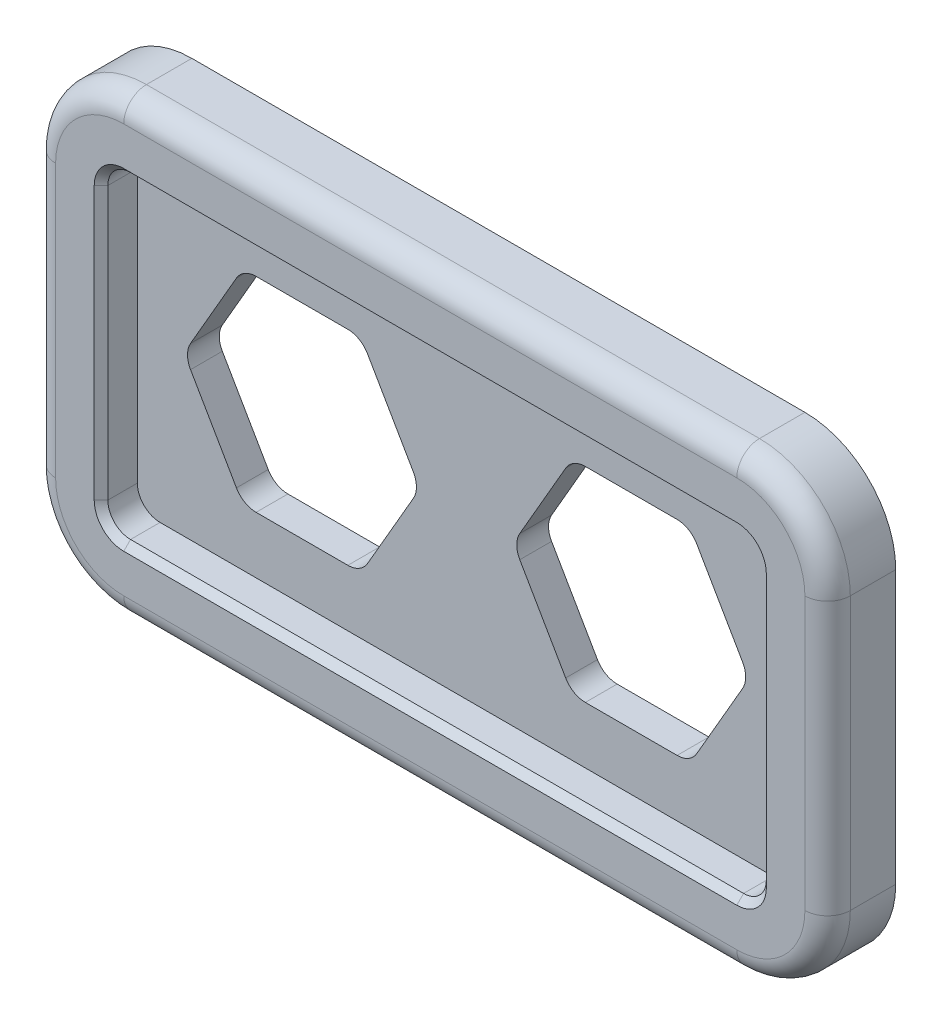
ISO-10303-21;
HEADER;
FILE_DESCRIPTION(('STEP AP214'),'2;1');
FILE_NAME('part.step','',(''),(''),'','','');
FILE_SCHEMA(('AUTOMOTIVE_DESIGN { 1 0 10303 214 1 1 1 1 }'));
ENDSEC;
DATA;
#1=APPLICATION_CONTEXT('core data for automotive mechanical design processes');
#2=APPLICATION_PROTOCOL_DEFINITION('international standard','automotive_design',2000,#1);
#3=PRODUCT_CONTEXT('',#1,'mechanical');
#4=PRODUCT('Part','Part','',(#3));
#5=PRODUCT_RELATED_PRODUCT_CATEGORY('part','',(#4));
#6=PRODUCT_DEFINITION_FORMATION('','',#4);
#7=PRODUCT_DEFINITION_CONTEXT('part definition',#1,'design');
#8=PRODUCT_DEFINITION('design','',#6,#7);
#9=PRODUCT_DEFINITION_SHAPE('','',#8);
#10=(LENGTH_UNIT() NAMED_UNIT(*) SI_UNIT(.MILLI.,.METRE.));
#11=(NAMED_UNIT(*) PLANE_ANGLE_UNIT() SI_UNIT($,.RADIAN.));
#12=(NAMED_UNIT(*) SI_UNIT($,.STERADIAN.) SOLID_ANGLE_UNIT());
#13=UNCERTAINTY_MEASURE_WITH_UNIT(LENGTH_MEASURE(1.E-05),#10,'distance_accuracy_value','');
#14=(GEOMETRIC_REPRESENTATION_CONTEXT(3) GLOBAL_UNCERTAINTY_ASSIGNED_CONTEXT((#13)) GLOBAL_UNIT_ASSIGNED_CONTEXT((#10,
#11,#12)) REPRESENTATION_CONTEXT('',''));
#15=CARTESIAN_POINT('',(0.,0.,0.));
#16=DIRECTION('',(0.,0.,1.));
#17=DIRECTION('',(1.,0.,0.));
#18=AXIS2_PLACEMENT_3D('',#15,#16,#17);
#19=CARTESIAN_POINT('',(-67.5,-30.,-8.));
#20=DIRECTION('',(0.,0.,-1.));
#21=DIRECTION('',(-1.,0.,0.));
#22=AXIS2_PLACEMENT_3D('',#19,#20,#21);
#23=PLANE('',#22);
#24=CARTESIAN_POINT('',(-67.5,-30.,-8.));
#25=DIRECTION('',(0.,0.,-1.));
#26=DIRECTION('',(-1.,0.,0.));
#27=AXIS2_PLACEMENT_3D('',#24,#25,#26);
#28=CIRCLE('',#27,5.);
#29=CARTESIAN_POINT('',(-67.5,-35.,-8.));
#30=VERTEX_POINT('',#29);
#31=CARTESIAN_POINT('',(-72.5,-30.,-8.));
#32=VERTEX_POINT('',#31);
#33=EDGE_CURVE('E349',#30,#32,#28,.T.);
#34=ORIENTED_EDGE('',*,*,#33,.F.);
#35=DIRECTION('',(1.,0.,0.));
#36=VECTOR('',#35,1.);
#37=CARTESIAN_POINT('',(-67.5,-35.,-8.));
#38=LINE('',#37,#36);
#39=CARTESIAN_POINT('',(67.5,-35.,-8.));
#40=VERTEX_POINT('',#39);
#41=EDGE_CURVE('E496',#30,#40,#38,.T.);
#42=ORIENTED_EDGE('',*,*,#41,.T.);
#43=CARTESIAN_POINT('',(67.5,-30.,-8.));
#44=DIRECTION('',(0.,0.,1.));
#45=DIRECTION('',(1.,0.,0.));
#46=AXIS2_PLACEMENT_3D('',#43,#44,#45);
#47=CIRCLE('',#46,4.99999999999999);
#48=CARTESIAN_POINT('',(72.5,-30.,-8.));
#49=VERTEX_POINT('',#48);
#50=EDGE_CURVE('E493',#40,#49,#47,.T.);
#51=ORIENTED_EDGE('',*,*,#50,.T.);
#52=DIRECTION('',(0.,1.,0.));
#53=VECTOR('',#52,1.);
#54=CARTESIAN_POINT('',(72.5,-30.,-8.));
#55=LINE('',#54,#53);
#56=CARTESIAN_POINT('',(72.5,30.,-8.));
#57=VERTEX_POINT('',#56);
#58=EDGE_CURVE('E485',#49,#57,#55,.T.);
#59=ORIENTED_EDGE('',*,*,#58,.T.);
#60=CARTESIAN_POINT('',(67.5,30.,-8.));
#61=DIRECTION('',(0.,0.,-1.));
#62=DIRECTION('',(-1.,0.,0.));
#63=AXIS2_PLACEMENT_3D('',#60,#61,#62);
#64=CIRCLE('',#63,4.99999999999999);
#65=CARTESIAN_POINT('',(67.5,35.,-8.));
#66=VERTEX_POINT('',#65);
#67=EDGE_CURVE('E482',#66,#57,#64,.T.);
#68=ORIENTED_EDGE('',*,*,#67,.F.);
#69=DIRECTION('',(1.,0.,0.));
#70=VECTOR('',#69,1.);
#71=CARTESIAN_POINT('',(-67.5,35.,-8.));
#72=LINE('',#71,#70);
#73=CARTESIAN_POINT('',(-67.5,35.,-8.));
#74=VERTEX_POINT('',#73);
#75=EDGE_CURVE('E479',#74,#66,#72,.T.);
#76=ORIENTED_EDGE('',*,*,#75,.F.);
#77=CARTESIAN_POINT('',(-67.5,30.,-8.));
#78=DIRECTION('',(0.,0.,-1.));
#79=DIRECTION('',(-1.,0.,0.));
#80=AXIS2_PLACEMENT_3D('',#77,#78,#79);
#81=CIRCLE('',#80,5.);
#82=CARTESIAN_POINT('',(-72.5,30.,-8.));
#83=VERTEX_POINT('',#82);
#84=EDGE_CURVE('E352',#83,#74,#81,.T.);
#85=ORIENTED_EDGE('',*,*,#84,.F.);
#86=DIRECTION('',(0.,1.,0.));
#87=VECTOR('',#86,1.);
#88=CARTESIAN_POINT('',(-72.5,-30.,-8.));
#89=LINE('',#88,#87);
#90=EDGE_CURVE('E345',#32,#83,#89,.T.);
#91=ORIENTED_EDGE('',*,*,#90,.F.);
#92=EDGE_LOOP('',(#34,#42,#51,#59,#68,#76,#85,#91));
#93=FACE_BOUND('',#92,.T.);
#94=DIRECTION('',(0.5,0.866025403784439,0.));
#95=VECTOR('',#94,1.);
#96=CARTESIAN_POINT('',(62.2307621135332,0.,-8.));
#97=LINE('',#96,#95);
#98=CARTESIAN_POINT('',(50.6837567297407,-20.,-8.));
#99=VERTEX_POINT('',#98);
#100=CARTESIAN_POINT('',(60.7873864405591,-2.5,-8.));
#101=VERTEX_POINT('',#100);
#102=EDGE_CURVE('E1120',#99,#101,#97,.T.);
#103=ORIENTED_EDGE('',*,*,#102,.F.);
#104=CARTESIAN_POINT('',(46.3536297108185,-17.5,-8.));
#105=DIRECTION('',(0.,0.,-1.));
#106=DIRECTION('',(-1.,0.,0.));
#107=AXIS2_PLACEMENT_3D('',#104,#105,#106);
#108=CIRCLE('',#107,5.);
#109=CARTESIAN_POINT('',(46.3536297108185,-22.5,-8.));
#110=VERTEX_POINT('',#109);
#111=EDGE_CURVE('E1129',#99,#110,#108,.T.);
#112=ORIENTED_EDGE('',*,*,#111,.T.);
#113=DIRECTION('',(1.,0.,0.));
#114=VECTOR('',#113,1.);
#115=CARTESIAN_POINT('',(49.2403810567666,-22.5,-8.));
#116=LINE('',#115,#114);
#117=CARTESIAN_POINT('',(26.1463702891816,-22.5,-8.));
#118=VERTEX_POINT('',#117);
#119=EDGE_CURVE('E1115',#118,#110,#116,.T.);
#120=ORIENTED_EDGE('',*,*,#119,.F.);
#121=CARTESIAN_POINT('',(26.1463702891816,-17.5,-8.));
#122=DIRECTION('',(0.,0.,-1.));
#123=DIRECTION('',(-1.,0.,0.));
#124=AXIS2_PLACEMENT_3D('',#121,#122,#123);
#125=CIRCLE('',#124,5.);
#126=CARTESIAN_POINT('',(21.8162432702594,-20.,-8.));
#127=VERTEX_POINT('',#126);
#128=EDGE_CURVE('E1207',#118,#127,#125,.T.);
#129=ORIENTED_EDGE('',*,*,#128,.T.);
#130=DIRECTION('',(0.5,-0.866025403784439,0.));
#131=VECTOR('',#130,1.);
#132=CARTESIAN_POINT('',(23.2596189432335,-22.5,-8.));
#133=LINE('',#132,#131);
#134=CARTESIAN_POINT('',(11.7126135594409,-2.5,-8.));
#135=VERTEX_POINT('',#134);
#136=EDGE_CURVE('E459',#135,#127,#133,.T.);
#137=ORIENTED_EDGE('',*,*,#136,.F.);
#138=CARTESIAN_POINT('',(16.0427405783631,0.,-8.));
#139=DIRECTION('',(0.,0.,-1.));
#140=DIRECTION('',(-1.,0.,0.));
#141=AXIS2_PLACEMENT_3D('',#138,#139,#140);
#142=CIRCLE('',#141,5.);
#143=CARTESIAN_POINT('',(11.712613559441,2.5,-8.));
#144=VERTEX_POINT('',#143);
#145=EDGE_CURVE('E445',#135,#144,#142,.T.);
#146=ORIENTED_EDGE('',*,*,#145,.T.);
#147=DIRECTION('',(-0.5,-0.866025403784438,0.));
#148=VECTOR('',#147,1.);
#149=CARTESIAN_POINT('',(10.2692378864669,0.,-8.));
#150=LINE('',#149,#148);
#151=CARTESIAN_POINT('',(21.8162432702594,20.,-8.));
#152=VERTEX_POINT('',#151);
#153=EDGE_CURVE('E463',#152,#144,#150,.T.);
#154=ORIENTED_EDGE('',*,*,#153,.F.);
#155=CARTESIAN_POINT('',(26.1463702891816,17.5,-8.));
#156=DIRECTION('',(0.,0.,-1.));
#157=DIRECTION('',(-1.,0.,0.));
#158=AXIS2_PLACEMENT_3D('',#155,#156,#157);
#159=CIRCLE('',#158,5.);
#160=CARTESIAN_POINT('',(26.1463702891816,22.5,-8.));
#161=VERTEX_POINT('',#160);
#162=EDGE_CURVE('E1151',#152,#161,#159,.T.);
#163=ORIENTED_EDGE('',*,*,#162,.T.);
#164=DIRECTION('',(-1.,0.,0.));
#165=VECTOR('',#164,1.);
#166=CARTESIAN_POINT('',(23.2596189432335,22.5,-8.));
#167=LINE('',#166,#165);
#168=CARTESIAN_POINT('',(46.3536297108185,22.5,-8.));
#169=VERTEX_POINT('',#168);
#170=EDGE_CURVE('E1147',#169,#161,#167,.T.);
#171=ORIENTED_EDGE('',*,*,#170,.F.);
#172=CARTESIAN_POINT('',(46.3536297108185,17.5,-8.));
#173=DIRECTION('',(0.,0.,-1.));
#174=DIRECTION('',(-1.,0.,0.));
#175=AXIS2_PLACEMENT_3D('',#172,#173,#174);
#176=CIRCLE('',#175,5.);
#177=CARTESIAN_POINT('',(50.6837567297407,20.,-8.));
#178=VERTEX_POINT('',#177);
#179=EDGE_CURVE('E1222',#169,#178,#176,.T.);
#180=ORIENTED_EDGE('',*,*,#179,.T.);
#181=DIRECTION('',(-0.5,0.866025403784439,0.));
#182=VECTOR('',#181,1.);
#183=CARTESIAN_POINT('',(49.2403810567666,22.5,-8.));
#184=LINE('',#183,#182);
#185=CARTESIAN_POINT('',(60.7873864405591,2.5,-8.));
#186=VERTEX_POINT('',#185);
#187=EDGE_CURVE('E1144',#186,#178,#184,.T.);
#188=ORIENTED_EDGE('',*,*,#187,.F.);
#189=CARTESIAN_POINT('',(56.4572594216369,0.,-8.));
#190=DIRECTION('',(0.,0.,-1.));
#191=DIRECTION('',(-1.,0.,0.));
#192=AXIS2_PLACEMENT_3D('',#189,#190,#191);
#193=CIRCLE('',#192,5.);
#194=EDGE_CURVE('E1136',#186,#101,#193,.T.);
#195=ORIENTED_EDGE('',*,*,#194,.T.);
#196=EDGE_LOOP('',(#103,#112,#120,#129,#137,#146,#154,#163,#171,#180,#188,#195));
#197=FACE_BOUND('',#196,.T.);
#198=DIRECTION('',(0.5,0.866025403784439,0.));
#199=VECTOR('',#198,1.);
#200=CARTESIAN_POINT('',(-23.2596189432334,-22.5,-8.));
#201=LINE('',#200,#199);
#202=CARTESIAN_POINT('',(-21.8162432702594,-20.,-8.));
#203=VERTEX_POINT('',#202);
#204=CARTESIAN_POINT('',(-11.7126135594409,-2.5,-8.));
#205=VERTEX_POINT('',#204);
#206=EDGE_CURVE('E1047',#203,#205,#201,.T.);
#207=ORIENTED_EDGE('',*,*,#206,.F.);
#208=CARTESIAN_POINT('',(-26.1463702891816,-17.5,-8.));
#209=DIRECTION('',(0.,0.,-1.));
#210=DIRECTION('',(-1.,0.,0.));
#211=AXIS2_PLACEMENT_3D('',#208,#209,#210);
#212=CIRCLE('',#211,5.);
#213=CARTESIAN_POINT('',(-26.1463702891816,-22.5,-8.));
#214=VERTEX_POINT('',#213);
#215=EDGE_CURVE('E1157',#203,#214,#212,.T.);
#216=ORIENTED_EDGE('',*,*,#215,.T.);
#217=DIRECTION('',(1.,0.,0.));
#218=VECTOR('',#217,1.);
#219=CARTESIAN_POINT('',(-49.2403810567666,-22.5,-8.));
#220=LINE('',#219,#218);
#221=CARTESIAN_POINT('',(-46.3536297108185,-22.5,-8.));
#222=VERTEX_POINT('',#221);
#223=EDGE_CURVE('E1085',#222,#214,#220,.T.);
#224=ORIENTED_EDGE('',*,*,#223,.F.);
#225=CARTESIAN_POINT('',(-46.3536297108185,-17.5,-8.));
#226=DIRECTION('',(0.,0.,-1.));
#227=DIRECTION('',(-1.,0.,0.));
#228=AXIS2_PLACEMENT_3D('',#225,#226,#227);
#229=CIRCLE('',#228,5.);
#230=CARTESIAN_POINT('',(-50.6837567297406,-20.,-8.));
#231=VERTEX_POINT('',#230);
#232=EDGE_CURVE('E1071',#222,#231,#229,.T.);
#233=ORIENTED_EDGE('',*,*,#232,.T.);
#234=DIRECTION('',(0.5,-0.866025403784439,0.));
#235=VECTOR('',#234,1.);
#236=CARTESIAN_POINT('',(-62.2307621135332,0.,-8.));
#237=LINE('',#236,#235);
#238=CARTESIAN_POINT('',(-60.7873864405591,-2.5,-8.));
#239=VERTEX_POINT('',#238);
#240=EDGE_CURVE('E1089',#239,#231,#237,.T.);
#241=ORIENTED_EDGE('',*,*,#240,.F.);
#242=CARTESIAN_POINT('',(-56.4572594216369,0.,-8.));
#243=DIRECTION('',(0.,0.,-1.));
#244=DIRECTION('',(-1.,0.,0.));
#245=AXIS2_PLACEMENT_3D('',#242,#243,#244);
#246=CIRCLE('',#245,5.);
#247=CARTESIAN_POINT('',(-60.7873864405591,2.5,-8.));
#248=VERTEX_POINT('',#247);
#249=EDGE_CURVE('E47',#239,#248,#246,.T.);
#250=ORIENTED_EDGE('',*,*,#249,.T.);
#251=DIRECTION('',(-0.5,-0.866025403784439,0.));
#252=VECTOR('',#251,1.);
#253=CARTESIAN_POINT('',(-49.2403810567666,22.5,-8.));
#254=LINE('',#253,#252);
#255=CARTESIAN_POINT('',(-50.6837567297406,20.,-8.));
#256=VERTEX_POINT('',#255);
#257=EDGE_CURVE('E1272',#256,#248,#254,.T.);
#258=ORIENTED_EDGE('',*,*,#257,.F.);
#259=CARTESIAN_POINT('',(-46.3536297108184,17.5,-8.));
#260=DIRECTION('',(0.,0.,-1.));
#261=DIRECTION('',(-1.,0.,0.));
#262=AXIS2_PLACEMENT_3D('',#259,#260,#261);
#263=CIRCLE('',#262,5.);
#264=CARTESIAN_POINT('',(-46.3536297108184,22.5,-8.));
#265=VERTEX_POINT('',#264);
#266=EDGE_CURVE('E1262',#256,#265,#263,.T.);
#267=ORIENTED_EDGE('',*,*,#266,.T.);
#268=DIRECTION('',(-1.,0.,0.));
#269=VECTOR('',#268,1.);
#270=CARTESIAN_POINT('',(-23.2596189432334,22.5,-8.));
#271=LINE('',#270,#269);
#272=CARTESIAN_POINT('',(-26.1463702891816,22.5,-8.));
#273=VERTEX_POINT('',#272);
#274=EDGE_CURVE('E1269',#273,#265,#271,.T.);
#275=ORIENTED_EDGE('',*,*,#274,.F.);
#276=CARTESIAN_POINT('',(-26.1463702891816,17.5,-8.));
#277=DIRECTION('',(0.,0.,-1.));
#278=DIRECTION('',(-1.,0.,0.));
#279=AXIS2_PLACEMENT_3D('',#276,#277,#278);
#280=CIRCLE('',#279,5.);
#281=CARTESIAN_POINT('',(-21.8162432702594,20.,-8.));
#282=VERTEX_POINT('',#281);
#283=EDGE_CURVE('E1259',#273,#282,#280,.T.);
#284=ORIENTED_EDGE('',*,*,#283,.T.);
#285=DIRECTION('',(-0.5,0.866025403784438,0.));
#286=VECTOR('',#285,1.);
#287=CARTESIAN_POINT('',(-10.2692378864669,0.,-8.));
#288=LINE('',#287,#286);
#289=CARTESIAN_POINT('',(-11.7126135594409,2.5,-8.));
#290=VERTEX_POINT('',#289);
#291=EDGE_CURVE('E1052',#290,#282,#288,.T.);
#292=ORIENTED_EDGE('',*,*,#291,.F.);
#293=CARTESIAN_POINT('',(-16.0427405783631,0.,-8.));
#294=DIRECTION('',(0.,0.,-1.));
#295=DIRECTION('',(-1.,0.,0.));
#296=AXIS2_PLACEMENT_3D('',#293,#294,#295);
#297=CIRCLE('',#296,5.);
#298=EDGE_CURVE('E1064',#290,#205,#297,.T.);
#299=ORIENTED_EDGE('',*,*,#298,.T.);
#300=EDGE_LOOP('',(#207,#216,#224,#233,#241,#250,#258,#267,#275,#284,#292,#299));
#301=FACE_BOUND('',#300,.T.);
#302=ADVANCED_FACE('F39',(#93,#197,#301),#23,.F.);
#303=CARTESIAN_POINT('',(-67.5,-30.,0.));
#304=DIRECTION('',(0.,0.,-1.));
#305=DIRECTION('',(-1.,0.,0.));
#306=AXIS2_PLACEMENT_3D('',#303,#304,#305);
#307=PLANE('',#306);
#308=CARTESIAN_POINT('',(67.5,-30.,0.));
#309=DIRECTION('',(0.,0.,-1.));
#310=DIRECTION('',(-1.,0.,0.));
#311=AXIS2_PLACEMENT_3D('',#308,#309,#310);
#312=CIRCLE('',#311,6.49999999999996);
#313=CARTESIAN_POINT('',(74.,-30.,0.));
#314=VERTEX_POINT('',#313);
#315=CARTESIAN_POINT('',(67.5,-36.5,0.));
#316=VERTEX_POINT('',#315);
#317=EDGE_CURVE('E616',#314,#316,#312,.T.);
#318=ORIENTED_EDGE('',*,*,#317,.T.);
#319=DIRECTION('',(-1.,0.,0.));
#320=VECTOR('',#319,1.);
#321=CARTESIAN_POINT('',(-67.5,-36.5,0.));
#322=LINE('',#321,#320);
#323=CARTESIAN_POINT('',(-67.5,-36.5,0.));
#324=VERTEX_POINT('',#323);
#325=EDGE_CURVE('E625',#316,#324,#322,.T.);
#326=ORIENTED_EDGE('',*,*,#325,.T.);
#327=CARTESIAN_POINT('',(-67.5,-30.,0.));
#328=DIRECTION('',(0.,0.,-1.));
#329=DIRECTION('',(-1.,0.,0.));
#330=AXIS2_PLACEMENT_3D('',#327,#328,#329);
#331=CIRCLE('',#330,6.49999999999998);
#332=CARTESIAN_POINT('',(-74.,-30.,0.));
#333=VERTEX_POINT('',#332);
#334=EDGE_CURVE('E623',#324,#333,#331,.T.);
#335=ORIENTED_EDGE('',*,*,#334,.T.);
#336=DIRECTION('',(0.,1.,0.));
#337=VECTOR('',#336,1.);
#338=CARTESIAN_POINT('',(-74.,30.,0.));
#339=LINE('',#338,#337);
#340=CARTESIAN_POINT('',(-74.,30.,0.));
#341=VERTEX_POINT('',#340);
#342=EDGE_CURVE('E612',#333,#341,#339,.T.);
#343=ORIENTED_EDGE('',*,*,#342,.T.);
#344=CARTESIAN_POINT('',(-67.5,30.,0.));
#345=DIRECTION('',(0.,0.,-1.));
#346=DIRECTION('',(-1.,0.,0.));
#347=AXIS2_PLACEMENT_3D('',#344,#345,#346);
#348=CIRCLE('',#347,6.49999999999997);
#349=CARTESIAN_POINT('',(-67.5,36.5,0.));
#350=VERTEX_POINT('',#349);
#351=EDGE_CURVE('E613',#341,#350,#348,.T.);
#352=ORIENTED_EDGE('',*,*,#351,.T.);
#353=DIRECTION('',(1.,0.,0.));
#354=VECTOR('',#353,1.);
#355=CARTESIAN_POINT('',(67.5,36.5,0.));
#356=LINE('',#355,#354);
#357=CARTESIAN_POINT('',(67.5,36.5,0.));
#358=VERTEX_POINT('',#357);
#359=EDGE_CURVE('E541',#350,#358,#356,.T.);
#360=ORIENTED_EDGE('',*,*,#359,.T.);
#361=CARTESIAN_POINT('',(67.5,30.,0.));
#362=DIRECTION('',(0.,0.,-1.));
#363=DIRECTION('',(-1.,0.,0.));
#364=AXIS2_PLACEMENT_3D('',#361,#362,#363);
#365=CIRCLE('',#364,6.49999999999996);
#366=CARTESIAN_POINT('',(74.,30.,0.));
#367=VERTEX_POINT('',#366);
#368=EDGE_CURVE('E599',#358,#367,#365,.T.);
#369=ORIENTED_EDGE('',*,*,#368,.T.);
#370=DIRECTION('',(0.,-1.,0.));
#371=VECTOR('',#370,1.);
#372=CARTESIAN_POINT('',(74.,-30.,0.));
#373=LINE('',#372,#371);
#374=EDGE_CURVE('E609',#367,#314,#373,.T.);
#375=ORIENTED_EDGE('',*,*,#374,.T.);
#376=EDGE_LOOP('',(#318,#326,#335,#343,#352,#360,#369,#375));
#377=FACE_BOUND('',#376,.T.);
#378=CARTESIAN_POINT('',(-67.5,-30.,0.));
#379=DIRECTION('',(0.,0.,-1.));
#380=DIRECTION('',(-1.,0.,0.));
#381=AXIS2_PLACEMENT_3D('',#378,#379,#380);
#382=CIRCLE('',#381,15.);
#383=CARTESIAN_POINT('',(-82.5,-30.,0.));
#384=VERTEX_POINT('',#383);
#385=CARTESIAN_POINT('',(-67.5,-45.,0.));
#386=VERTEX_POINT('',#385);
#387=EDGE_CURVE('E1301',#384,#386,#382,.F.);
#388=ORIENTED_EDGE('',*,*,#387,.T.);
#389=DIRECTION('',(1.,0.,0.));
#390=VECTOR('',#389,1.);
#391=CARTESIAN_POINT('',(67.5,-45.,0.));
#392=LINE('',#391,#390);
#393=CARTESIAN_POINT('',(67.5,-45.,0.));
#394=VERTEX_POINT('',#393);
#395=EDGE_CURVE('E1322',#386,#394,#392,.T.);
#396=ORIENTED_EDGE('',*,*,#395,.T.);
#397=CARTESIAN_POINT('',(67.5,-30.,0.));
#398=DIRECTION('',(0.,0.,-1.));
#399=DIRECTION('',(-1.,0.,0.));
#400=AXIS2_PLACEMENT_3D('',#397,#398,#399);
#401=CIRCLE('',#400,15.);
#402=CARTESIAN_POINT('',(82.5,-30.,0.));
#403=VERTEX_POINT('',#402);
#404=EDGE_CURVE('E1320',#394,#403,#401,.F.);
#405=ORIENTED_EDGE('',*,*,#404,.T.);
#406=DIRECTION('',(0.,1.,0.));
#407=VECTOR('',#406,1.);
#408=CARTESIAN_POINT('',(82.5,30.,0.));
#409=LINE('',#408,#407);
#410=CARTESIAN_POINT('',(82.5,30.,0.));
#411=VERTEX_POINT('',#410);
#412=EDGE_CURVE('E1318',#403,#411,#409,.T.);
#413=ORIENTED_EDGE('',*,*,#412,.T.);
#414=CARTESIAN_POINT('',(67.5,30.,0.));
#415=DIRECTION('',(0.,0.,-1.));
#416=DIRECTION('',(-1.,0.,0.));
#417=AXIS2_PLACEMENT_3D('',#414,#415,#416);
#418=CIRCLE('',#417,15.);
#419=CARTESIAN_POINT('',(67.5,45.,0.));
#420=VERTEX_POINT('',#419);
#421=EDGE_CURVE('E1316',#411,#420,#418,.F.);
#422=ORIENTED_EDGE('',*,*,#421,.T.);
#423=DIRECTION('',(1.,0.,0.));
#424=VECTOR('',#423,1.);
#425=CARTESIAN_POINT('',(-67.5,45.,0.));
#426=LINE('',#425,#424);
#427=CARTESIAN_POINT('',(-67.5,45.,0.));
#428=VERTEX_POINT('',#427);
#429=EDGE_CURVE('E1314',#420,#428,#426,.F.);
#430=ORIENTED_EDGE('',*,*,#429,.T.);
#431=CARTESIAN_POINT('',(-67.5,30.,0.));
#432=DIRECTION('',(0.,0.,-1.));
#433=DIRECTION('',(-1.,0.,0.));
#434=AXIS2_PLACEMENT_3D('',#431,#432,#433);
#435=CIRCLE('',#434,15.);
#436=CARTESIAN_POINT('',(-82.5,30.,0.));
#437=VERTEX_POINT('',#436);
#438=EDGE_CURVE('E1312',#428,#437,#435,.F.);
#439=ORIENTED_EDGE('',*,*,#438,.T.);
#440=DIRECTION('',(0.,1.,0.));
#441=VECTOR('',#440,1.);
#442=CARTESIAN_POINT('',(-82.5,-30.,0.));
#443=LINE('',#442,#441);
#444=EDGE_CURVE('E1304',#437,#384,#443,.F.);
#445=ORIENTED_EDGE('',*,*,#444,.T.);
#446=EDGE_LOOP('',(#388,#396,#405,#413,#422,#430,#439,#445));
#447=FACE_BOUND('',#446,.T.);
#448=ADVANCED_FACE('F656',(#377,#447),#307,.F.);
#449=CARTESIAN_POINT('',(-67.5,-30.,-15.));
#450=DIRECTION('',(0.,0.,1.));
#451=DIRECTION('',(1.,0.,0.));
#452=AXIS2_PLACEMENT_3D('',#449,#450,#451);
#453=CYLINDRICAL_SURFACE('',#452,20.);
#454=DIRECTION('',(0.,0.,1.));
#455=VECTOR('',#454,1.);
#456=CARTESIAN_POINT('',(-67.5,-50.,-15.));
#457=LINE('',#456,#455);
#458=CARTESIAN_POINT('',(-67.5,-50.,-15.));
#459=VERTEX_POINT('',#458);
#460=CARTESIAN_POINT('',(-67.5,-50.,-5.));
#461=VERTEX_POINT('',#460);
#462=EDGE_CURVE('E1388',#459,#461,#457,.T.);
#463=ORIENTED_EDGE('',*,*,#462,.T.);
#464=CARTESIAN_POINT('',(-67.5,-30.,-5.));
#465=DIRECTION('',(0.,0.,-1.));
#466=DIRECTION('',(-1.,0.,0.));
#467=AXIS2_PLACEMENT_3D('',#464,#465,#466);
#468=CIRCLE('',#467,20.);
#469=CARTESIAN_POINT('',(-87.5,-30.,-5.));
#470=VERTEX_POINT('',#469);
#471=EDGE_CURVE('E595',#461,#470,#468,.T.);
#472=ORIENTED_EDGE('',*,*,#471,.T.);
#473=DIRECTION('',(0.,0.,1.));
#474=VECTOR('',#473,1.);
#475=CARTESIAN_POINT('',(-87.5,-30.,-15.));
#476=LINE('',#475,#474);
#477=CARTESIAN_POINT('',(-87.5,-30.,-15.));
#478=VERTEX_POINT('',#477);
#479=EDGE_CURVE('E1297',#478,#470,#476,.T.);
#480=ORIENTED_EDGE('',*,*,#479,.F.);
#481=CARTESIAN_POINT('',(-67.5,-30.,-15.));
#482=DIRECTION('',(0.,0.,-1.));
#483=DIRECTION('',(-1.,0.,0.));
#484=AXIS2_PLACEMENT_3D('',#481,#482,#483);
#485=CIRCLE('',#484,20.);
#486=EDGE_CURVE('E370',#459,#478,#485,.T.);
#487=ORIENTED_EDGE('',*,*,#486,.F.);
#488=EDGE_LOOP('',(#463,#472,#480,#487));
#489=FACE_BOUND('',#488,.T.);
#490=ADVANCED_FACE('F690',(#489),#453,.T.);
#491=CARTESIAN_POINT('',(-87.5,-30.,-15.));
#492=DIRECTION('',(1.,0.,0.));
#493=DIRECTION('',(0.,0.,-1.));
#494=AXIS2_PLACEMENT_3D('',#491,#492,#493);
#495=PLANE('',#494);
#496=ORIENTED_EDGE('',*,*,#479,.T.);
#497=DIRECTION('',(0.,1.,0.));
#498=VECTOR('',#497,1.);
#499=CARTESIAN_POINT('',(-87.5,-30.,-5.));
#500=LINE('',#499,#498);
#501=CARTESIAN_POINT('',(-87.5,30.,-5.));
#502=VERTEX_POINT('',#501);
#503=EDGE_CURVE('E1338',#470,#502,#500,.T.);
#504=ORIENTED_EDGE('',*,*,#503,.T.);
#505=DIRECTION('',(0.,0.,1.));
#506=VECTOR('',#505,1.);
#507=CARTESIAN_POINT('',(-87.5,30.,-15.));
#508=LINE('',#507,#506);
#509=CARTESIAN_POINT('',(-87.5,30.,-15.));
#510=VERTEX_POINT('',#509);
#511=EDGE_CURVE('E1302',#510,#502,#508,.T.);
#512=ORIENTED_EDGE('',*,*,#511,.F.);
#513=DIRECTION('',(0.,1.,0.));
#514=VECTOR('',#513,1.);
#515=CARTESIAN_POINT('',(-87.5,-30.,-15.));
#516=LINE('',#515,#514);
#517=EDGE_CURVE('E374',#478,#510,#516,.T.);
#518=ORIENTED_EDGE('',*,*,#517,.F.);
#519=EDGE_LOOP('',(#496,#504,#512,#518));
#520=FACE_BOUND('',#519,.T.);
#521=ADVANCED_FACE('F1412',(#520),#495,.F.);
#522=CARTESIAN_POINT('',(-67.5,30.,-15.));
#523=DIRECTION('',(0.,0.,1.));
#524=DIRECTION('',(1.,0.,0.));
#525=AXIS2_PLACEMENT_3D('',#522,#523,#524);
#526=CYLINDRICAL_SURFACE('',#525,20.);
#527=ORIENTED_EDGE('',*,*,#511,.T.);
#528=CARTESIAN_POINT('',(-67.5,30.,-5.));
#529=DIRECTION('',(0.,0.,-1.));
#530=DIRECTION('',(-1.,0.,0.));
#531=AXIS2_PLACEMENT_3D('',#528,#529,#530);
#532=CIRCLE('',#531,20.);
#533=CARTESIAN_POINT('',(-67.5,50.,-5.));
#534=VERTEX_POINT('',#533);
#535=EDGE_CURVE('E1336',#502,#534,#532,.T.);
#536=ORIENTED_EDGE('',*,*,#535,.T.);
#537=DIRECTION('',(0.,0.,1.));
#538=VECTOR('',#537,1.);
#539=CARTESIAN_POINT('',(-67.5,50.,-15.));
#540=LINE('',#539,#538);
#541=CARTESIAN_POINT('',(-67.5,50.,-15.));
#542=VERTEX_POINT('',#541);
#543=EDGE_CURVE('E1307',#542,#534,#540,.T.);
#544=ORIENTED_EDGE('',*,*,#543,.F.);
#545=CARTESIAN_POINT('',(-67.5,30.,-15.));
#546=DIRECTION('',(0.,0.,-1.));
#547=DIRECTION('',(-1.,0.,0.));
#548=AXIS2_PLACEMENT_3D('',#545,#546,#547);
#549=CIRCLE('',#548,20.);
#550=EDGE_CURVE('E1028',#510,#542,#549,.T.);
#551=ORIENTED_EDGE('',*,*,#550,.F.);
#552=EDGE_LOOP('',(#527,#536,#544,#551));
#553=FACE_BOUND('',#552,.T.);
#554=ADVANCED_FACE('F1415',(#553),#526,.T.);
#555=CARTESIAN_POINT('',(-67.5,50.,-15.));
#556=DIRECTION('',(0.,-1.,0.));
#557=DIRECTION('',(0.,0.,-1.));
#558=AXIS2_PLACEMENT_3D('',#555,#556,#557);
#559=PLANE('',#558);
#560=ORIENTED_EDGE('',*,*,#543,.T.);
#561=DIRECTION('',(1.,0.,0.));
#562=VECTOR('',#561,1.);
#563=CARTESIAN_POINT('',(-67.5,50.,-5.));
#564=LINE('',#563,#562);
#565=CARTESIAN_POINT('',(67.5,50.,-5.));
#566=VERTEX_POINT('',#565);
#567=EDGE_CURVE('E1334',#534,#566,#564,.T.);
#568=ORIENTED_EDGE('',*,*,#567,.T.);
#569=DIRECTION('',(0.,0.,1.));
#570=VECTOR('',#569,1.);
#571=CARTESIAN_POINT('',(67.5,50.,-15.));
#572=LINE('',#571,#570);
#573=CARTESIAN_POINT('',(67.5,50.,-15.));
#574=VERTEX_POINT('',#573);
#575=EDGE_CURVE('E1371',#574,#566,#572,.T.);
#576=ORIENTED_EDGE('',*,*,#575,.F.);
#577=DIRECTION('',(1.,0.,0.));
#578=VECTOR('',#577,1.);
#579=CARTESIAN_POINT('',(-67.5,50.,-15.));
#580=LINE('',#579,#578);
#581=EDGE_CURVE('E1025',#542,#574,#580,.T.);
#582=ORIENTED_EDGE('',*,*,#581,.F.);
#583=EDGE_LOOP('',(#560,#568,#576,#582));
#584=FACE_BOUND('',#583,.T.);
#585=ADVANCED_FACE('F1370',(#584),#559,.F.);
#586=CARTESIAN_POINT('',(67.5,30.,-15.));
#587=DIRECTION('',(0.,0.,1.));
#588=DIRECTION('',(1.,0.,0.));
#589=AXIS2_PLACEMENT_3D('',#586,#587,#588);
#590=CYLINDRICAL_SURFACE('',#589,20.);
#591=ORIENTED_EDGE('',*,*,#575,.T.);
#592=CARTESIAN_POINT('',(67.5,30.,-5.));
#593=DIRECTION('',(0.,0.,-1.));
#594=DIRECTION('',(-1.,0.,0.));
#595=AXIS2_PLACEMENT_3D('',#592,#593,#594);
#596=CIRCLE('',#595,20.);
#597=CARTESIAN_POINT('',(87.5,30.,-5.));
#598=VERTEX_POINT('',#597);
#599=EDGE_CURVE('E1332',#566,#598,#596,.T.);
#600=ORIENTED_EDGE('',*,*,#599,.T.);
#601=DIRECTION('',(0.,0.,1.));
#602=VECTOR('',#601,1.);
#603=CARTESIAN_POINT('',(87.5,30.,-15.));
#604=LINE('',#603,#602);
#605=CARTESIAN_POINT('',(87.5,30.,-15.));
#606=VERTEX_POINT('',#605);
#607=EDGE_CURVE('E1378',#606,#598,#604,.T.);
#608=ORIENTED_EDGE('',*,*,#607,.F.);
#609=CARTESIAN_POINT('',(67.5,30.,-15.));
#610=DIRECTION('',(0.,0.,-1.));
#611=DIRECTION('',(-1.,0.,0.));
#612=AXIS2_PLACEMENT_3D('',#609,#610,#611);
#613=CIRCLE('',#612,20.);
#614=EDGE_CURVE('E1027',#574,#606,#613,.T.);
#615=ORIENTED_EDGE('',*,*,#614,.F.);
#616=EDGE_LOOP('',(#591,#600,#608,#615));
#617=FACE_BOUND('',#616,.T.);
#618=ADVANCED_FACE('F1375',(#617),#590,.T.);
#619=CARTESIAN_POINT('',(87.5,-30.,-15.));
#620=DIRECTION('',(1.,0.,0.));
#621=DIRECTION('',(0.,0.,-1.));
#622=AXIS2_PLACEMENT_3D('',#619,#620,#621);
#623=PLANE('',#622);
#624=ORIENTED_EDGE('',*,*,#607,.T.);
#625=DIRECTION('',(0.,1.,0.));
#626=VECTOR('',#625,1.);
#627=CARTESIAN_POINT('',(87.5,-30.,-5.));
#628=LINE('',#627,#626);
#629=CARTESIAN_POINT('',(87.5,-30.,-5.));
#630=VERTEX_POINT('',#629);
#631=EDGE_CURVE('E1330',#598,#630,#628,.F.);
#632=ORIENTED_EDGE('',*,*,#631,.T.);
#633=DIRECTION('',(0.,0.,1.));
#634=VECTOR('',#633,1.);
#635=CARTESIAN_POINT('',(87.5,-30.,-15.));
#636=LINE('',#635,#634);
#637=CARTESIAN_POINT('',(87.5,-30.,-15.));
#638=VERTEX_POINT('',#637);
#639=EDGE_CURVE('E1380',#638,#630,#636,.T.);
#640=ORIENTED_EDGE('',*,*,#639,.F.);
#641=DIRECTION('',(0.,1.,0.));
#642=VECTOR('',#641,1.);
#643=CARTESIAN_POINT('',(87.5,-30.,-15.));
#644=LINE('',#643,#642);
#645=EDGE_CURVE('E1033',#638,#606,#644,.T.);
#646=ORIENTED_EDGE('',*,*,#645,.T.);
#647=EDGE_LOOP('',(#624,#632,#640,#646));
#648=FACE_BOUND('',#647,.T.);
#649=ADVANCED_FACE('F1396',(#648),#623,.T.);
#650=CARTESIAN_POINT('',(67.5,-30.,-15.));
#651=DIRECTION('',(0.,0.,1.));
#652=DIRECTION('',(1.,0.,0.));
#653=AXIS2_PLACEMENT_3D('',#650,#651,#652);
#654=CYLINDRICAL_SURFACE('',#653,20.);
#655=ORIENTED_EDGE('',*,*,#639,.T.);
#656=CARTESIAN_POINT('',(67.5,-30.,-5.));
#657=DIRECTION('',(0.,0.,-1.));
#658=DIRECTION('',(-1.,0.,0.));
#659=AXIS2_PLACEMENT_3D('',#656,#657,#658);
#660=CIRCLE('',#659,20.);
#661=CARTESIAN_POINT('',(67.5,-50.,-5.));
#662=VERTEX_POINT('',#661);
#663=EDGE_CURVE('E1328',#630,#662,#660,.T.);
#664=ORIENTED_EDGE('',*,*,#663,.T.);
#665=DIRECTION('',(0.,0.,1.));
#666=VECTOR('',#665,1.);
#667=CARTESIAN_POINT('',(67.5,-50.,-15.));
#668=LINE('',#667,#666);
#669=CARTESIAN_POINT('',(67.5,-50.,-15.));
#670=VERTEX_POINT('',#669);
#671=EDGE_CURVE('E1385',#670,#662,#668,.T.);
#672=ORIENTED_EDGE('',*,*,#671,.F.);
#673=CARTESIAN_POINT('',(67.5,-30.,-15.));
#674=DIRECTION('',(0.,0.,1.));
#675=DIRECTION('',(1.,0.,0.));
#676=AXIS2_PLACEMENT_3D('',#673,#674,#675);
#677=CIRCLE('',#676,20.);
#678=EDGE_CURVE('E1391',#670,#638,#677,.T.);
#679=ORIENTED_EDGE('',*,*,#678,.T.);
#680=EDGE_LOOP('',(#655,#664,#672,#679));
#681=FACE_BOUND('',#680,.T.);
#682=ADVANCED_FACE('F1399',(#681),#654,.T.);
#683=CARTESIAN_POINT('',(-67.5,-50.,-15.));
#684=DIRECTION('',(0.,-1.,0.));
#685=DIRECTION('',(0.,0.,-1.));
#686=AXIS2_PLACEMENT_3D('',#683,#684,#685);
#687=PLANE('',#686);
#688=ORIENTED_EDGE('',*,*,#671,.T.);
#689=DIRECTION('',(1.,0.,0.));
#690=VECTOR('',#689,1.);
#691=CARTESIAN_POINT('',(-67.5,-50.,-5.));
#692=LINE('',#691,#690);
#693=EDGE_CURVE('E1325',#662,#461,#692,.F.);
#694=ORIENTED_EDGE('',*,*,#693,.T.);
#695=ORIENTED_EDGE('',*,*,#462,.F.);
#696=DIRECTION('',(1.,0.,0.));
#697=VECTOR('',#696,1.);
#698=CARTESIAN_POINT('',(-67.5,-50.,-15.));
#699=LINE('',#698,#697);
#700=EDGE_CURVE('E1293',#459,#670,#699,.T.);
#701=ORIENTED_EDGE('',*,*,#700,.T.);
#702=EDGE_LOOP('',(#688,#694,#695,#701));
#703=FACE_BOUND('',#702,.T.);
#704=ADVANCED_FACE('F1285',(#703),#687,.T.);
#705=CARTESIAN_POINT('',(-67.5,-30.,-15.));
#706=DIRECTION('',(0.,0.,-1.));
#707=DIRECTION('',(-1.,0.,0.));
#708=AXIS2_PLACEMENT_3D('',#705,#706,#707);
#709=PLANE('',#708);
#710=DIRECTION('',(1.,0.,0.));
#711=VECTOR('',#710,1.);
#712=CARTESIAN_POINT('',(-49.2403810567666,-22.5,-15.));
#713=LINE('',#712,#711);
#714=CARTESIAN_POINT('',(-46.3536297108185,-22.5,-15.));
#715=VERTEX_POINT('',#714);
#716=CARTESIAN_POINT('',(-26.1463702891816,-22.5,-15.));
#717=VERTEX_POINT('',#716);
#718=EDGE_CURVE('E1039',#715,#717,#713,.T.);
#719=ORIENTED_EDGE('',*,*,#718,.T.);
#720=CARTESIAN_POINT('',(-26.1463702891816,-17.5,-15.));
#721=DIRECTION('',(0.,0.,-1.));
#722=DIRECTION('',(-1.,0.,0.));
#723=AXIS2_PLACEMENT_3D('',#720,#721,#722);
#724=CIRCLE('',#723,5.);
#725=CARTESIAN_POINT('',(-21.8162432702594,-20.,-15.));
#726=VERTEX_POINT('',#725);
#727=EDGE_CURVE('E1069',#717,#726,#724,.F.);
#728=ORIENTED_EDGE('',*,*,#727,.T.);
#729=DIRECTION('',(0.5,0.866025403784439,0.));
#730=VECTOR('',#729,1.);
#731=CARTESIAN_POINT('',(-23.2596189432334,-22.5,-15.));
#732=LINE('',#731,#730);
#733=CARTESIAN_POINT('',(-11.7126135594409,-2.5,-15.));
#734=VERTEX_POINT('',#733);
#735=EDGE_CURVE('E1088',#726,#734,#732,.T.);
#736=ORIENTED_EDGE('',*,*,#735,.T.);
#737=CARTESIAN_POINT('',(-16.0427405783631,0.,-15.));
#738=DIRECTION('',(0.,0.,-1.));
#739=DIRECTION('',(-1.,0.,0.));
#740=AXIS2_PLACEMENT_3D('',#737,#738,#739);
#741=CIRCLE('',#740,5.);
#742=CARTESIAN_POINT('',(-11.7126135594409,2.5,-15.));
#743=VERTEX_POINT('',#742);
#744=EDGE_CURVE('E1068',#734,#743,#741,.F.);
#745=ORIENTED_EDGE('',*,*,#744,.T.);
#746=DIRECTION('',(-0.5,0.866025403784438,0.));
#747=VECTOR('',#746,1.);
#748=CARTESIAN_POINT('',(-10.2692378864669,0.,-15.));
#749=LINE('',#748,#747);
#750=CARTESIAN_POINT('',(-21.8162432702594,20.,-15.));
#751=VERTEX_POINT('',#750);
#752=EDGE_CURVE('E1174',#743,#751,#749,.T.);
#753=ORIENTED_EDGE('',*,*,#752,.T.);
#754=CARTESIAN_POINT('',(-26.1463702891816,17.5,-15.));
#755=DIRECTION('',(0.,0.,-1.));
#756=DIRECTION('',(-1.,0.,0.));
#757=AXIS2_PLACEMENT_3D('',#754,#755,#756);
#758=CIRCLE('',#757,5.);
#759=CARTESIAN_POINT('',(-26.1463702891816,22.5,-15.));
#760=VERTEX_POINT('',#759);
#761=EDGE_CURVE('E1260',#751,#760,#758,.F.);
#762=ORIENTED_EDGE('',*,*,#761,.T.);
#763=DIRECTION('',(-1.,0.,0.));
#764=VECTOR('',#763,1.);
#765=CARTESIAN_POINT('',(-23.2596189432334,22.5,-15.));
#766=LINE('',#765,#764);
#767=CARTESIAN_POINT('',(-46.3536297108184,22.5,-15.));
#768=VERTEX_POINT('',#767);
#769=EDGE_CURVE('E1240',#760,#768,#766,.T.);
#770=ORIENTED_EDGE('',*,*,#769,.T.);
#771=CARTESIAN_POINT('',(-46.3536297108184,17.5,-15.));
#772=DIRECTION('',(0.,0.,-1.));
#773=DIRECTION('',(-1.,0.,0.));
#774=AXIS2_PLACEMENT_3D('',#771,#772,#773);
#775=CIRCLE('',#774,5.);
#776=CARTESIAN_POINT('',(-50.6837567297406,20.,-15.));
#777=VERTEX_POINT('',#776);
#778=EDGE_CURVE('E61',#768,#777,#775,.F.);
#779=ORIENTED_EDGE('',*,*,#778,.T.);
#780=DIRECTION('',(-0.5,-0.866025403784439,0.));
#781=VECTOR('',#780,1.);
#782=CARTESIAN_POINT('',(-49.2403810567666,22.5,-15.));
#783=LINE('',#782,#781);
#784=CARTESIAN_POINT('',(-60.7873864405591,2.5,-15.));
#785=VERTEX_POINT('',#784);
#786=EDGE_CURVE('E1242',#777,#785,#783,.T.);
#787=ORIENTED_EDGE('',*,*,#786,.T.);
#788=CARTESIAN_POINT('',(-56.4572594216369,0.,-15.));
#789=DIRECTION('',(0.,0.,-1.));
#790=DIRECTION('',(-1.,0.,0.));
#791=AXIS2_PLACEMENT_3D('',#788,#789,#790);
#792=CIRCLE('',#791,5.);
#793=CARTESIAN_POINT('',(-60.7873864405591,-2.5,-15.));
#794=VERTEX_POINT('',#793);
#795=EDGE_CURVE('E12',#785,#794,#792,.F.);
#796=ORIENTED_EDGE('',*,*,#795,.T.);
#797=DIRECTION('',(0.5,-0.866025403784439,0.));
#798=VECTOR('',#797,1.);
#799=CARTESIAN_POINT('',(-62.2307621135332,0.,-15.));
#800=LINE('',#799,#798);
#801=CARTESIAN_POINT('',(-50.6837567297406,-20.,-15.));
#802=VERTEX_POINT('',#801);
#803=EDGE_CURVE('E1044',#794,#802,#800,.T.);
#804=ORIENTED_EDGE('',*,*,#803,.T.);
#805=CARTESIAN_POINT('',(-46.3536297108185,-17.5,-15.));
#806=DIRECTION('',(0.,0.,-1.));
#807=DIRECTION('',(-1.,0.,0.));
#808=AXIS2_PLACEMENT_3D('',#805,#806,#807);
#809=CIRCLE('',#808,5.);
#810=EDGE_CURVE('E1074',#802,#715,#809,.F.);
#811=ORIENTED_EDGE('',*,*,#810,.T.);
#812=EDGE_LOOP('',(#719,#728,#736,#745,#753,#762,#770,#779,#787,#796,#804,#811));
#813=FACE_BOUND('',#812,.T.);
#814=DIRECTION('',(0.5,-0.866025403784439,0.));
#815=VECTOR('',#814,1.);
#816=CARTESIAN_POINT('',(23.2596189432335,-22.5,-15.));
#817=LINE('',#816,#815);
#818=CARTESIAN_POINT('',(11.7126135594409,-2.5,-15.));
#819=VERTEX_POINT('',#818);
#820=CARTESIAN_POINT('',(21.8162432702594,-20.,-15.));
#821=VERTEX_POINT('',#820);
#822=EDGE_CURVE('E1053',#819,#821,#817,.T.);
#823=ORIENTED_EDGE('',*,*,#822,.T.);
#824=CARTESIAN_POINT('',(26.1463702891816,-17.5,-15.));
#825=DIRECTION('',(0.,0.,-1.));
#826=DIRECTION('',(-1.,0.,0.));
#827=AXIS2_PLACEMENT_3D('',#824,#825,#826);
#828=CIRCLE('',#827,5.);
#829=CARTESIAN_POINT('',(26.1463702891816,-22.5,-15.));
#830=VERTEX_POINT('',#829);
#831=EDGE_CURVE('E1134',#821,#830,#828,.F.);
#832=ORIENTED_EDGE('',*,*,#831,.T.);
#833=DIRECTION('',(1.,0.,0.));
#834=VECTOR('',#833,1.);
#835=CARTESIAN_POINT('',(49.2403810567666,-22.5,-15.));
#836=LINE('',#835,#834);
#837=CARTESIAN_POINT('',(46.3536297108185,-22.5,-15.));
#838=VERTEX_POINT('',#837);
#839=EDGE_CURVE('E462',#830,#838,#836,.T.);
#840=ORIENTED_EDGE('',*,*,#839,.T.);
#841=CARTESIAN_POINT('',(46.3536297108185,-17.5,-15.));
#842=DIRECTION('',(0.,0.,-1.));
#843=DIRECTION('',(-1.,0.,0.));
#844=AXIS2_PLACEMENT_3D('',#841,#842,#843);
#845=CIRCLE('',#844,5.);
#846=CARTESIAN_POINT('',(50.6837567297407,-20.,-15.));
#847=VERTEX_POINT('',#846);
#848=EDGE_CURVE('E1133',#838,#847,#845,.F.);
#849=ORIENTED_EDGE('',*,*,#848,.T.);
#850=DIRECTION('',(0.5,0.866025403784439,0.));
#851=VECTOR('',#850,1.);
#852=CARTESIAN_POINT('',(62.2307621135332,0.,-15.));
#853=LINE('',#852,#851);
#854=CARTESIAN_POINT('',(60.7873864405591,-2.5,-15.));
#855=VERTEX_POINT('',#854);
#856=EDGE_CURVE('E1095',#847,#855,#853,.T.);
#857=ORIENTED_EDGE('',*,*,#856,.T.);
#858=CARTESIAN_POINT('',(56.4572594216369,0.,-15.));
#859=DIRECTION('',(0.,0.,-1.));
#860=DIRECTION('',(-1.,0.,0.));
#861=AXIS2_PLACEMENT_3D('',#858,#859,#860);
#862=CIRCLE('',#861,5.);
#863=CARTESIAN_POINT('',(60.7873864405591,2.5,-15.));
#864=VERTEX_POINT('',#863);
#865=EDGE_CURVE('E1139',#855,#864,#862,.F.);
#866=ORIENTED_EDGE('',*,*,#865,.T.);
#867=DIRECTION('',(-0.5,0.866025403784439,0.));
#868=VECTOR('',#867,1.);
#869=CARTESIAN_POINT('',(49.2403810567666,22.5,-15.));
#870=LINE('',#869,#868);
#871=CARTESIAN_POINT('',(50.6837567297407,20.,-15.));
#872=VERTEX_POINT('',#871);
#873=EDGE_CURVE('E1099',#864,#872,#870,.T.);
#874=ORIENTED_EDGE('',*,*,#873,.T.);
#875=CARTESIAN_POINT('',(46.3536297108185,17.5,-15.));
#876=DIRECTION('',(0.,0.,-1.));
#877=DIRECTION('',(-1.,0.,0.));
#878=AXIS2_PLACEMENT_3D('',#875,#876,#877);
#879=CIRCLE('',#878,5.);
#880=CARTESIAN_POINT('',(46.3536297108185,22.5,-15.));
#881=VERTEX_POINT('',#880);
#882=EDGE_CURVE('E1156',#872,#881,#879,.F.);
#883=ORIENTED_EDGE('',*,*,#882,.T.);
#884=DIRECTION('',(-1.,0.,0.));
#885=VECTOR('',#884,1.);
#886=CARTESIAN_POINT('',(23.2596189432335,22.5,-15.));
#887=LINE('',#886,#885);
#888=CARTESIAN_POINT('',(26.1463702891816,22.5,-15.));
#889=VERTEX_POINT('',#888);
#890=EDGE_CURVE('E1106',#881,#889,#887,.T.);
#891=ORIENTED_EDGE('',*,*,#890,.T.);
#892=CARTESIAN_POINT('',(26.1463702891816,17.5,-15.));
#893=DIRECTION('',(0.,0.,-1.));
#894=DIRECTION('',(-1.,0.,0.));
#895=AXIS2_PLACEMENT_3D('',#892,#893,#894);
#896=CIRCLE('',#895,5.);
#897=CARTESIAN_POINT('',(21.8162432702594,20.,-15.));
#898=VERTEX_POINT('',#897);
#899=EDGE_CURVE('E1155',#889,#898,#896,.F.);
#900=ORIENTED_EDGE('',*,*,#899,.T.);
#901=DIRECTION('',(-0.5,-0.866025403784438,0.));
#902=VECTOR('',#901,1.);
#903=CARTESIAN_POINT('',(10.2692378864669,0.,-15.));
#904=LINE('',#903,#902);
#905=CARTESIAN_POINT('',(11.712613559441,2.5,-15.));
#906=VERTEX_POINT('',#905);
#907=EDGE_CURVE('E1109',#898,#906,#904,.T.);
#908=ORIENTED_EDGE('',*,*,#907,.T.);
#909=CARTESIAN_POINT('',(16.0427405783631,0.,-15.));
#910=DIRECTION('',(0.,0.,-1.));
#911=DIRECTION('',(-1.,0.,0.));
#912=AXIS2_PLACEMENT_3D('',#909,#910,#911);
#913=CIRCLE('',#912,5.);
#914=EDGE_CURVE('E448',#906,#819,#913,.F.);
#915=ORIENTED_EDGE('',*,*,#914,.T.);
#916=EDGE_LOOP('',(#823,#832,#840,#849,#857,#866,#874,#883,#891,#900,#908,#915));
#917=FACE_BOUND('',#916,.T.);
#918=ORIENTED_EDGE('',*,*,#486,.T.);
#919=ORIENTED_EDGE('',*,*,#517,.T.);
#920=ORIENTED_EDGE('',*,*,#550,.T.);
#921=ORIENTED_EDGE('',*,*,#581,.T.);
#922=ORIENTED_EDGE('',*,*,#614,.T.);
#923=ORIENTED_EDGE('',*,*,#645,.F.);
#924=ORIENTED_EDGE('',*,*,#678,.F.);
#925=ORIENTED_EDGE('',*,*,#700,.F.);
#926=EDGE_LOOP('',(#918,#919,#920,#921,#922,#923,#924,#925));
#927=FACE_BOUND('',#926,.T.);
#928=ADVANCED_FACE('F1165',(#813,#917,#927),#709,.T.);
#929=CARTESIAN_POINT('',(-67.5,-30.,-8.));
#930=DIRECTION('',(0.,0.,1.));
#931=DIRECTION('',(1.,0.,0.));
#932=AXIS2_PLACEMENT_3D('',#929,#930,#931);
#933=CYLINDRICAL_SURFACE('',#932,5.);
#934=DIRECTION('',(0.,0.,1.));
#935=VECTOR('',#934,1.);
#936=CARTESIAN_POINT('',(-72.5,-30.,-8.));
#937=LINE('',#936,#935);
#938=CARTESIAN_POINT('',(-72.5,-30.,-1.5));
#939=VERTEX_POINT('',#938);
#940=EDGE_CURVE('E361',#32,#939,#937,.T.);
#941=ORIENTED_EDGE('',*,*,#940,.T.);
#942=CARTESIAN_POINT('',(-67.5,-30.,-1.5));
#943=DIRECTION('',(0.,0.,-1.));
#944=DIRECTION('',(-1.,0.,0.));
#945=AXIS2_PLACEMENT_3D('',#942,#943,#944);
#946=CIRCLE('',#945,5.);
#947=CARTESIAN_POINT('',(-67.5,-35.,-1.5));
#948=VERTEX_POINT('',#947);
#949=EDGE_CURVE('E629',#939,#948,#946,.F.);
#950=ORIENTED_EDGE('',*,*,#949,.T.);
#951=DIRECTION('',(0.,0.,1.));
#952=VECTOR('',#951,1.);
#953=CARTESIAN_POINT('',(-67.5,-35.,-8.));
#954=LINE('',#953,#952);
#955=EDGE_CURVE('E364',#30,#948,#954,.T.);
#956=ORIENTED_EDGE('',*,*,#955,.F.);
#957=ORIENTED_EDGE('',*,*,#33,.T.);
#958=EDGE_LOOP('',(#941,#950,#956,#957));
#959=FACE_BOUND('',#958,.T.);
#960=ADVANCED_FACE('F360',(#959),#933,.F.);
#961=CARTESIAN_POINT('',(-72.5,-30.,-8.));
#962=DIRECTION('',(1.,0.,0.));
#963=DIRECTION('',(0.,0.,-1.));
#964=AXIS2_PLACEMENT_3D('',#961,#962,#963);
#965=PLANE('',#964);
#966=DIRECTION('',(0.,0.,1.));
#967=VECTOR('',#966,1.);
#968=CARTESIAN_POINT('',(-72.5,30.,-8.));
#969=LINE('',#968,#967);
#970=CARTESIAN_POINT('',(-72.5,30.,-1.5));
#971=VERTEX_POINT('',#970);
#972=EDGE_CURVE('E371',#83,#971,#969,.T.);
#973=ORIENTED_EDGE('',*,*,#972,.T.);
#974=DIRECTION('',(0.,-1.,0.));
#975=VECTOR('',#974,1.);
#976=CARTESIAN_POINT('',(-72.5,-30.,-1.5));
#977=LINE('',#976,#975);
#978=EDGE_CURVE('E369',#971,#939,#977,.T.);
#979=ORIENTED_EDGE('',*,*,#978,.T.);
#980=ORIENTED_EDGE('',*,*,#940,.F.);
#981=ORIENTED_EDGE('',*,*,#90,.T.);
#982=EDGE_LOOP('',(#973,#979,#980,#981));
#983=FACE_BOUND('',#982,.T.);
#984=ADVANCED_FACE('F367',(#983),#965,.T.);
#985=CARTESIAN_POINT('',(-67.5,30.,-8.));
#986=DIRECTION('',(0.,0.,1.));
#987=DIRECTION('',(1.,0.,0.));
#988=AXIS2_PLACEMENT_3D('',#985,#986,#987);
#989=CYLINDRICAL_SURFACE('',#988,5.);
#990=DIRECTION('',(0.,0.,1.));
#991=VECTOR('',#990,1.);
#992=CARTESIAN_POINT('',(-67.5,35.,-8.));
#993=LINE('',#992,#991);
#994=CARTESIAN_POINT('',(-67.5,35.,-1.5));
#995=VERTEX_POINT('',#994);
#996=EDGE_CURVE('E376',#74,#995,#993,.T.);
#997=ORIENTED_EDGE('',*,*,#996,.T.);
#998=CARTESIAN_POINT('',(-67.5,30.,-1.5));
#999=DIRECTION('',(0.,0.,-1.));
#1000=DIRECTION('',(-1.,0.,0.));
#1001=AXIS2_PLACEMENT_3D('',#998,#999,#1000);
#1002=CIRCLE('',#1001,5.);
#1003=EDGE_CURVE('E530',#995,#971,#1002,.F.);
#1004=ORIENTED_EDGE('',*,*,#1003,.T.);
#1005=ORIENTED_EDGE('',*,*,#972,.F.);
#1006=ORIENTED_EDGE('',*,*,#84,.T.);
#1007=EDGE_LOOP('',(#997,#1004,#1005,#1006));
#1008=FACE_BOUND('',#1007,.T.);
#1009=ADVANCED_FACE('F528',(#1008),#989,.F.);
#1010=CARTESIAN_POINT('',(-67.5,35.,-8.));
#1011=DIRECTION('',(0.,-1.,0.));
#1012=DIRECTION('',(0.,0.,-1.));
#1013=AXIS2_PLACEMENT_3D('',#1010,#1011,#1012);
#1014=PLANE('',#1013);
#1015=DIRECTION('',(0.,0.,1.));
#1016=VECTOR('',#1015,1.);
#1017=CARTESIAN_POINT('',(67.5,35.,-8.));
#1018=LINE('',#1017,#1016);
#1019=CARTESIAN_POINT('',(67.5,35.,-1.5));
#1020=VERTEX_POINT('',#1019);
#1021=EDGE_CURVE('E520',#66,#1020,#1018,.T.);
#1022=ORIENTED_EDGE('',*,*,#1021,.T.);
#1023=DIRECTION('',(-1.,0.,0.));
#1024=VECTOR('',#1023,1.);
#1025=CARTESIAN_POINT('',(-67.5,35.,-1.5));
#1026=LINE('',#1025,#1024);
#1027=EDGE_CURVE('E539',#1020,#995,#1026,.T.);
#1028=ORIENTED_EDGE('',*,*,#1027,.T.);
#1029=ORIENTED_EDGE('',*,*,#996,.F.);
#1030=ORIENTED_EDGE('',*,*,#75,.T.);
#1031=EDGE_LOOP('',(#1022,#1028,#1029,#1030));
#1032=FACE_BOUND('',#1031,.T.);
#1033=ADVANCED_FACE('F676',(#1032),#1014,.T.);
#1034=CARTESIAN_POINT('',(67.5,30.,-8.));
#1035=DIRECTION('',(0.,0.,1.));
#1036=DIRECTION('',(1.,0.,0.));
#1037=AXIS2_PLACEMENT_3D('',#1034,#1035,#1036);
#1038=CYLINDRICAL_SURFACE('',#1037,4.99999999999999);
#1039=DIRECTION('',(0.,0.,1.));
#1040=VECTOR('',#1039,1.);
#1041=CARTESIAN_POINT('',(72.5,30.,-8.));
#1042=LINE('',#1041,#1040);
#1043=CARTESIAN_POINT('',(72.5,30.,-1.5));
#1044=VERTEX_POINT('',#1043);
#1045=EDGE_CURVE('E516',#57,#1044,#1042,.T.);
#1046=ORIENTED_EDGE('',*,*,#1045,.T.);
#1047=CARTESIAN_POINT('',(67.5,30.,-1.5));
#1048=DIRECTION('',(0.,0.,-1.));
#1049=DIRECTION('',(-1.,0.,0.));
#1050=AXIS2_PLACEMENT_3D('',#1047,#1048,#1049);
#1051=CIRCLE('',#1050,4.99999999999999);
#1052=EDGE_CURVE('E550',#1044,#1020,#1051,.F.);
#1053=ORIENTED_EDGE('',*,*,#1052,.T.);
#1054=ORIENTED_EDGE('',*,*,#1021,.F.);
#1055=ORIENTED_EDGE('',*,*,#67,.T.);
#1056=EDGE_LOOP('',(#1046,#1053,#1054,#1055));
#1057=FACE_BOUND('',#1056,.T.);
#1058=ADVANCED_FACE('F674',(#1057),#1038,.F.);
#1059=CARTESIAN_POINT('',(72.5,-30.,-8.));
#1060=DIRECTION('',(1.,0.,0.));
#1061=DIRECTION('',(0.,0.,-1.));
#1062=AXIS2_PLACEMENT_3D('',#1059,#1060,#1061);
#1063=PLANE('',#1062);
#1064=DIRECTION('',(0.,0.,1.));
#1065=VECTOR('',#1064,1.);
#1066=CARTESIAN_POINT('',(72.5,-30.,-8.));
#1067=LINE('',#1066,#1065);
#1068=CARTESIAN_POINT('',(72.5,-30.,-1.5));
#1069=VERTEX_POINT('',#1068);
#1070=EDGE_CURVE('E513',#49,#1069,#1067,.T.);
#1071=ORIENTED_EDGE('',*,*,#1070,.T.);
#1072=DIRECTION('',(0.,1.,0.));
#1073=VECTOR('',#1072,1.);
#1074=CARTESIAN_POINT('',(72.5,-30.,-1.5));
#1075=LINE('',#1074,#1073);
#1076=EDGE_CURVE('E551',#1069,#1044,#1075,.T.);
#1077=ORIENTED_EDGE('',*,*,#1076,.T.);
#1078=ORIENTED_EDGE('',*,*,#1045,.F.);
#1079=ORIENTED_EDGE('',*,*,#58,.F.);
#1080=EDGE_LOOP('',(#1071,#1077,#1078,#1079));
#1081=FACE_BOUND('',#1080,.T.);
#1082=ADVANCED_FACE('F643',(#1081),#1063,.F.);
#1083=CARTESIAN_POINT('',(67.5,-30.,-8.));
#1084=DIRECTION('',(0.,0.,1.));
#1085=DIRECTION('',(1.,0.,0.));
#1086=AXIS2_PLACEMENT_3D('',#1083,#1084,#1085);
#1087=CYLINDRICAL_SURFACE('',#1086,4.99999999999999);
#1088=DIRECTION('',(0.,0.,1.));
#1089=VECTOR('',#1088,1.);
#1090=CARTESIAN_POINT('',(67.5,-35.,-8.));
#1091=LINE('',#1090,#1089);
#1092=CARTESIAN_POINT('',(67.5,-35.,-1.5));
#1093=VERTEX_POINT('',#1092);
#1094=EDGE_CURVE('E501',#40,#1093,#1091,.T.);
#1095=ORIENTED_EDGE('',*,*,#1094,.T.);
#1096=CARTESIAN_POINT('',(67.5,-30.,-1.5));
#1097=DIRECTION('',(0.,0.,-1.));
#1098=DIRECTION('',(-1.,0.,0.));
#1099=AXIS2_PLACEMENT_3D('',#1096,#1097,#1098);
#1100=CIRCLE('',#1099,4.99999999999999);
#1101=EDGE_CURVE('E631',#1093,#1069,#1100,.F.);
#1102=ORIENTED_EDGE('',*,*,#1101,.T.);
#1103=ORIENTED_EDGE('',*,*,#1070,.F.);
#1104=ORIENTED_EDGE('',*,*,#50,.F.);
#1105=EDGE_LOOP('',(#1095,#1102,#1103,#1104));
#1106=FACE_BOUND('',#1105,.T.);
#1107=ADVANCED_FACE('F636',(#1106),#1087,.F.);
#1108=CARTESIAN_POINT('',(-67.5,-35.,-8.));
#1109=DIRECTION('',(0.,-1.,0.));
#1110=DIRECTION('',(1.,0.,0.));
#1111=AXIS2_PLACEMENT_3D('',#1108,#1109,#1110);
#1112=PLANE('',#1111);
#1113=ORIENTED_EDGE('',*,*,#955,.T.);
#1114=DIRECTION('',(1.,0.,0.));
#1115=VECTOR('',#1114,1.);
#1116=CARTESIAN_POINT('',(-67.5,-35.,-1.5));
#1117=LINE('',#1116,#1115);
#1118=EDGE_CURVE('E590',#948,#1093,#1117,.T.);
#1119=ORIENTED_EDGE('',*,*,#1118,.T.);
#1120=ORIENTED_EDGE('',*,*,#1094,.F.);
#1121=ORIENTED_EDGE('',*,*,#41,.F.);
#1122=EDGE_LOOP('',(#1113,#1119,#1120,#1121));
#1123=FACE_BOUND('',#1122,.T.);
#1124=ADVANCED_FACE('F670',(#1123),#1112,.F.);
#1125=CARTESIAN_POINT('',(-67.5,45.,-5.));
#1126=DIRECTION('',(1.,0.,0.));
#1127=DIRECTION('',(0.,0.,-1.));
#1128=AXIS2_PLACEMENT_3D('',#1125,#1126,#1127);
#1129=CYLINDRICAL_SURFACE('',#1128,5.);
#1130=CARTESIAN_POINT('',(67.5,45.,-5.));
#1131=DIRECTION('',(1.,0.,0.));
#1132=DIRECTION('',(0.,0.,-1.));
#1133=AXIS2_PLACEMENT_3D('',#1130,#1131,#1132);
#1134=CIRCLE('',#1133,5.);
#1135=EDGE_CURVE('E1355',#566,#420,#1134,.T.);
#1136=ORIENTED_EDGE('',*,*,#1135,.F.);
#1137=ORIENTED_EDGE('',*,*,#567,.F.);
#1138=CARTESIAN_POINT('',(-67.5,45.,-5.));
#1139=DIRECTION('',(-1.,0.,0.));
#1140=DIRECTION('',(0.,0.,1.));
#1141=AXIS2_PLACEMENT_3D('',#1138,#1139,#1140);
#1142=CIRCLE('',#1141,5.);
#1143=EDGE_CURVE('E365',#428,#534,#1142,.T.);
#1144=ORIENTED_EDGE('',*,*,#1143,.F.);
#1145=ORIENTED_EDGE('',*,*,#429,.F.);
#1146=EDGE_LOOP('',(#1136,#1137,#1144,#1145));
#1147=FACE_BOUND('',#1146,.T.);
#1148=ADVANCED_FACE('F698',(#1147),#1129,.T.);
#1149=CARTESIAN_POINT('',(-67.5,30.,-5.));
#1150=DIRECTION('',(0.,0.,-1.));
#1151=DIRECTION('',(-1.,0.,0.));
#1152=AXIS2_PLACEMENT_3D('',#1149,#1150,#1151);
#1153=TOROIDAL_SURFACE('',#1152,15.,5.);
#1154=ORIENTED_EDGE('',*,*,#1143,.T.);
#1155=ORIENTED_EDGE('',*,*,#535,.F.);
#1156=CARTESIAN_POINT('',(-82.5,30.,-5.));
#1157=DIRECTION('',(0.,-1.,0.));
#1158=DIRECTION('',(0.,0.,-1.));
#1159=AXIS2_PLACEMENT_3D('',#1156,#1157,#1158);
#1160=CIRCLE('',#1159,5.);
#1161=EDGE_CURVE('E1353',#437,#502,#1160,.T.);
#1162=ORIENTED_EDGE('',*,*,#1161,.F.);
#1163=ORIENTED_EDGE('',*,*,#438,.F.);
#1164=EDGE_LOOP('',(#1154,#1155,#1162,#1163));
#1165=FACE_BOUND('',#1164,.T.);
#1166=ADVANCED_FACE('F722',(#1165),#1153,.T.);
#1167=CARTESIAN_POINT('',(67.5,30.,-5.));
#1168=DIRECTION('',(0.,0.,-1.));
#1169=DIRECTION('',(-1.,0.,0.));
#1170=AXIS2_PLACEMENT_3D('',#1167,#1168,#1169);
#1171=TOROIDAL_SURFACE('',#1170,15.,5.);
#1172=ORIENTED_EDGE('',*,*,#1135,.T.);
#1173=ORIENTED_EDGE('',*,*,#421,.F.);
#1174=CARTESIAN_POINT('',(82.5,30.,-5.));
#1175=DIRECTION('',(0.,-1.,0.));
#1176=DIRECTION('',(0.,0.,-1.));
#1177=AXIS2_PLACEMENT_3D('',#1174,#1175,#1176);
#1178=CIRCLE('',#1177,5.);
#1179=EDGE_CURVE('E1350',#598,#411,#1178,.T.);
#1180=ORIENTED_EDGE('',*,*,#1179,.F.);
#1181=ORIENTED_EDGE('',*,*,#599,.F.);
#1182=EDGE_LOOP('',(#1172,#1173,#1180,#1181));
#1183=FACE_BOUND('',#1182,.T.);
#1184=ADVANCED_FACE('F731',(#1183),#1171,.T.);
#1185=CARTESIAN_POINT('',(-82.5,-30.,-5.));
#1186=DIRECTION('',(0.,1.,0.));
#1187=DIRECTION('',(0.,0.,1.));
#1188=AXIS2_PLACEMENT_3D('',#1185,#1186,#1187);
#1189=CYLINDRICAL_SURFACE('',#1188,5.);
#1190=ORIENTED_EDGE('',*,*,#1161,.T.);
#1191=ORIENTED_EDGE('',*,*,#503,.F.);
#1192=CARTESIAN_POINT('',(-82.5,-30.,-5.));
#1193=DIRECTION('',(0.,-1.,0.));
#1194=DIRECTION('',(0.,0.,-1.));
#1195=AXIS2_PLACEMENT_3D('',#1192,#1193,#1194);
#1196=CIRCLE('',#1195,5.);
#1197=EDGE_CURVE('E1347',#384,#470,#1196,.T.);
#1198=ORIENTED_EDGE('',*,*,#1197,.F.);
#1199=ORIENTED_EDGE('',*,*,#444,.F.);
#1200=EDGE_LOOP('',(#1190,#1191,#1198,#1199));
#1201=FACE_BOUND('',#1200,.T.);
#1202=ADVANCED_FACE('F739',(#1201),#1189,.T.);
#1203=CARTESIAN_POINT('',(82.5,-30.,-5.));
#1204=DIRECTION('',(0.,-1.,0.));
#1205=DIRECTION('',(0.,0.,-1.));
#1206=AXIS2_PLACEMENT_3D('',#1203,#1204,#1205);
#1207=CYLINDRICAL_SURFACE('',#1206,5.);
#1208=ORIENTED_EDGE('',*,*,#1179,.T.);
#1209=ORIENTED_EDGE('',*,*,#412,.F.);
#1210=CARTESIAN_POINT('',(82.5,-30.,-5.));
#1211=DIRECTION('',(0.,-1.,0.));
#1212=DIRECTION('',(0.,0.,-1.));
#1213=AXIS2_PLACEMENT_3D('',#1210,#1211,#1212);
#1214=CIRCLE('',#1213,5.);
#1215=EDGE_CURVE('E1344',#630,#403,#1214,.T.);
#1216=ORIENTED_EDGE('',*,*,#1215,.F.);
#1217=ORIENTED_EDGE('',*,*,#631,.F.);
#1218=EDGE_LOOP('',(#1208,#1209,#1216,#1217));
#1219=FACE_BOUND('',#1218,.T.);
#1220=ADVANCED_FACE('F747',(#1219),#1207,.T.);
#1221=CARTESIAN_POINT('',(-67.5,-30.,-5.));
#1222=DIRECTION('',(0.,0.,-1.));
#1223=DIRECTION('',(-1.,0.,0.));
#1224=AXIS2_PLACEMENT_3D('',#1221,#1222,#1223);
#1225=TOROIDAL_SURFACE('',#1224,15.,5.);
#1226=ORIENTED_EDGE('',*,*,#1197,.T.);
#1227=ORIENTED_EDGE('',*,*,#471,.F.);
#1228=CARTESIAN_POINT('',(-67.5,-45.,-5.));
#1229=DIRECTION('',(1.,0.,0.));
#1230=DIRECTION('',(0.,0.,-1.));
#1231=AXIS2_PLACEMENT_3D('',#1228,#1229,#1230);
#1232=CIRCLE('',#1231,5.);
#1233=EDGE_CURVE('E1342',#386,#461,#1232,.T.);
#1234=ORIENTED_EDGE('',*,*,#1233,.F.);
#1235=ORIENTED_EDGE('',*,*,#387,.F.);
#1236=EDGE_LOOP('',(#1226,#1227,#1234,#1235));
#1237=FACE_BOUND('',#1236,.T.);
#1238=ADVANCED_FACE('F755',(#1237),#1225,.T.);
#1239=CARTESIAN_POINT('',(67.5,-30.,-5.));
#1240=DIRECTION('',(0.,0.,-1.));
#1241=DIRECTION('',(-1.,0.,0.));
#1242=AXIS2_PLACEMENT_3D('',#1239,#1240,#1241);
#1243=TOROIDAL_SURFACE('',#1242,15.,5.);
#1244=ORIENTED_EDGE('',*,*,#1215,.T.);
#1245=ORIENTED_EDGE('',*,*,#404,.F.);
#1246=CARTESIAN_POINT('',(67.5,-45.,-5.));
#1247=DIRECTION('',(-1.,0.,0.));
#1248=DIRECTION('',(0.,0.,1.));
#1249=AXIS2_PLACEMENT_3D('',#1246,#1247,#1248);
#1250=CIRCLE('',#1249,5.);
#1251=EDGE_CURVE('E544',#662,#394,#1250,.T.);
#1252=ORIENTED_EDGE('',*,*,#1251,.F.);
#1253=ORIENTED_EDGE('',*,*,#663,.F.);
#1254=EDGE_LOOP('',(#1244,#1245,#1252,#1253));
#1255=FACE_BOUND('',#1254,.T.);
#1256=ADVANCED_FACE('F763',(#1255),#1243,.T.);
#1257=CARTESIAN_POINT('',(-67.5,-45.,-5.));
#1258=DIRECTION('',(-1.,0.,0.));
#1259=DIRECTION('',(0.,0.,1.));
#1260=AXIS2_PLACEMENT_3D('',#1257,#1258,#1259);
#1261=CYLINDRICAL_SURFACE('',#1260,5.);
#1262=ORIENTED_EDGE('',*,*,#1233,.T.);
#1263=ORIENTED_EDGE('',*,*,#693,.F.);
#1264=ORIENTED_EDGE('',*,*,#1251,.T.);
#1265=ORIENTED_EDGE('',*,*,#395,.F.);
#1266=EDGE_LOOP('',(#1262,#1263,#1264,#1265));
#1267=FACE_BOUND('',#1266,.T.);
#1268=ADVANCED_FACE('F771',(#1267),#1261,.T.);
#1269=CARTESIAN_POINT('',(-67.5,36.5,0.));
#1270=DIRECTION('',(0.,-0.707106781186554,0.707106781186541));
#1271=DIRECTION('',(-1.,0.,0.));
#1272=AXIS2_PLACEMENT_3D('',#1269,#1270,#1271);
#1273=PLANE('',#1272);
#1274=DIRECTION('',(0.,-0.707106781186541,-0.707106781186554));
#1275=VECTOR('',#1274,1.);
#1276=CARTESIAN_POINT('',(67.5,36.5,0.));
#1277=LINE('',#1276,#1275);
#1278=EDGE_CURVE('E545',#358,#1020,#1277,.T.);
#1279=ORIENTED_EDGE('',*,*,#1278,.F.);
#1280=ORIENTED_EDGE('',*,*,#359,.F.);
#1281=DIRECTION('',(0.,0.707106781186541,0.707106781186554));
#1282=VECTOR('',#1281,1.);
#1283=CARTESIAN_POINT('',(-67.5,35.,-1.5));
#1284=LINE('',#1283,#1282);
#1285=EDGE_CURVE('E536',#995,#350,#1284,.T.);
#1286=ORIENTED_EDGE('',*,*,#1285,.F.);
#1287=ORIENTED_EDGE('',*,*,#1027,.F.);
#1288=EDGE_LOOP('',(#1279,#1280,#1286,#1287));
#1289=FACE_BOUND('',#1288,.T.);
#1290=ADVANCED_FACE('F538',(#1289),#1273,.T.);
#1291=CARTESIAN_POINT('',(-67.5,30.,0.));
#1292=DIRECTION('',(0.,0.,1.));
#1293=DIRECTION('',(1.,0.,0.));
#1294=AXIS2_PLACEMENT_3D('',#1291,#1292,#1293);
#1295=CONICAL_SURFACE('',#1294,6.49999999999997,0.785398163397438);
#1296=ORIENTED_EDGE('',*,*,#1285,.T.);
#1297=ORIENTED_EDGE('',*,*,#351,.F.);
#1298=DIRECTION('',(-0.707106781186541,0.,0.707106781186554));
#1299=VECTOR('',#1298,1.);
#1300=CARTESIAN_POINT('',(-72.5,30.,-1.5));
#1301=LINE('',#1300,#1299);
#1302=EDGE_CURVE('E549',#971,#341,#1301,.T.);
#1303=ORIENTED_EDGE('',*,*,#1302,.F.);
#1304=ORIENTED_EDGE('',*,*,#1003,.F.);
#1305=EDGE_LOOP('',(#1296,#1297,#1303,#1304));
#1306=FACE_BOUND('',#1305,.T.);
#1307=ADVANCED_FACE('F547',(#1306),#1295,.F.);
#1308=CARTESIAN_POINT('',(67.5,30.,0.));
#1309=DIRECTION('',(0.,0.,1.));
#1310=DIRECTION('',(1.,0.,0.));
#1311=AXIS2_PLACEMENT_3D('',#1308,#1309,#1310);
#1312=CONICAL_SURFACE('',#1311,6.49999999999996,0.78539816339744);
#1313=ORIENTED_EDGE('',*,*,#1278,.T.);
#1314=ORIENTED_EDGE('',*,*,#1052,.F.);
#1315=DIRECTION('',(-0.707106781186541,0.,-0.707106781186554));
#1316=VECTOR('',#1315,1.);
#1317=CARTESIAN_POINT('',(74.,30.,0.));
#1318=LINE('',#1317,#1316);
#1319=EDGE_CURVE('E569',#367,#1044,#1318,.T.);
#1320=ORIENTED_EDGE('',*,*,#1319,.F.);
#1321=ORIENTED_EDGE('',*,*,#368,.F.);
#1322=EDGE_LOOP('',(#1313,#1314,#1320,#1321));
#1323=FACE_BOUND('',#1322,.T.);
#1324=ADVANCED_FACE('F794',(#1323),#1312,.F.);
#1325=CARTESIAN_POINT('',(-74.,-30.,0.));
#1326=DIRECTION('',(0.707106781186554,0.,0.707106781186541));
#1327=DIRECTION('',(0.,-1.,0.));
#1328=AXIS2_PLACEMENT_3D('',#1325,#1326,#1327);
#1329=PLANE('',#1328);
#1330=ORIENTED_EDGE('',*,*,#1302,.T.);
#1331=ORIENTED_EDGE('',*,*,#342,.F.);
#1332=DIRECTION('',(-0.707106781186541,0.,0.707106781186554));
#1333=VECTOR('',#1332,1.);
#1334=CARTESIAN_POINT('',(-72.5,-30.,-1.5));
#1335=LINE('',#1334,#1333);
#1336=EDGE_CURVE('E582',#939,#333,#1335,.T.);
#1337=ORIENTED_EDGE('',*,*,#1336,.F.);
#1338=ORIENTED_EDGE('',*,*,#978,.F.);
#1339=EDGE_LOOP('',(#1330,#1331,#1337,#1338));
#1340=FACE_BOUND('',#1339,.T.);
#1341=ADVANCED_FACE('F668',(#1340),#1329,.T.);
#1342=CARTESIAN_POINT('',(72.5,-30.,-1.5));
#1343=DIRECTION('',(0.707106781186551,0.,-0.707106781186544));
#1344=DIRECTION('',(0.,1.,0.));
#1345=AXIS2_PLACEMENT_3D('',#1342,#1343,#1344);
#1346=PLANE('',#1345);
#1347=ORIENTED_EDGE('',*,*,#1319,.T.);
#1348=ORIENTED_EDGE('',*,*,#1076,.F.);
#1349=DIRECTION('',(-0.707106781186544,0.,-0.707106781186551));
#1350=VECTOR('',#1349,1.);
#1351=CARTESIAN_POINT('',(74.,-30.,0.));
#1352=LINE('',#1351,#1350);
#1353=EDGE_CURVE('E579',#314,#1069,#1352,.T.);
#1354=ORIENTED_EDGE('',*,*,#1353,.F.);
#1355=ORIENTED_EDGE('',*,*,#374,.F.);
#1356=EDGE_LOOP('',(#1347,#1348,#1354,#1355));
#1357=FACE_BOUND('',#1356,.T.);
#1358=ADVANCED_FACE('F649',(#1357),#1346,.F.);
#1359=CARTESIAN_POINT('',(-67.5,-30.,0.));
#1360=DIRECTION('',(0.,0.,1.));
#1361=DIRECTION('',(1.,0.,0.));
#1362=AXIS2_PLACEMENT_3D('',#1359,#1360,#1361);
#1363=CONICAL_SURFACE('',#1362,6.49999999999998,0.785398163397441);
#1364=ORIENTED_EDGE('',*,*,#1336,.T.);
#1365=ORIENTED_EDGE('',*,*,#334,.F.);
#1366=DIRECTION('',(0.,-0.707106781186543,0.707106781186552));
#1367=VECTOR('',#1366,1.);
#1368=CARTESIAN_POINT('',(-67.5,-35.,-1.5));
#1369=LINE('',#1368,#1367);
#1370=EDGE_CURVE('E583',#948,#324,#1369,.T.);
#1371=ORIENTED_EDGE('',*,*,#1370,.F.);
#1372=ORIENTED_EDGE('',*,*,#949,.F.);
#1373=EDGE_LOOP('',(#1364,#1365,#1371,#1372));
#1374=FACE_BOUND('',#1373,.T.);
#1375=ADVANCED_FACE('F665',(#1374),#1363,.F.);
#1376=CARTESIAN_POINT('',(67.5,-30.,-1.5));
#1377=DIRECTION('',(0.,0.,1.));
#1378=DIRECTION('',(1.,0.,0.));
#1379=AXIS2_PLACEMENT_3D('',#1376,#1377,#1378);
#1380=CONICAL_SURFACE('',#1379,4.99999999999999,0.785398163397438);
#1381=ORIENTED_EDGE('',*,*,#1353,.T.);
#1382=ORIENTED_EDGE('',*,*,#1101,.F.);
#1383=DIRECTION('',(0.,0.707106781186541,-0.707106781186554));
#1384=VECTOR('',#1383,1.);
#1385=CARTESIAN_POINT('',(67.5,-36.5,0.));
#1386=LINE('',#1385,#1384);
#1387=EDGE_CURVE('E559',#316,#1093,#1386,.T.);
#1388=ORIENTED_EDGE('',*,*,#1387,.F.);
#1389=ORIENTED_EDGE('',*,*,#317,.F.);
#1390=EDGE_LOOP('',(#1381,#1382,#1388,#1389));
#1391=FACE_BOUND('',#1390,.T.);
#1392=ADVANCED_FACE('F653',(#1391),#1380,.F.);
#1393=CARTESIAN_POINT('',(-67.5,-35.,-1.5));
#1394=DIRECTION('',(0.,-0.707106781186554,-0.707106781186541));
#1395=DIRECTION('',(1.,0.,0.));
#1396=AXIS2_PLACEMENT_3D('',#1393,#1394,#1395);
#1397=PLANE('',#1396);
#1398=ORIENTED_EDGE('',*,*,#1370,.T.);
#1399=ORIENTED_EDGE('',*,*,#325,.F.);
#1400=ORIENTED_EDGE('',*,*,#1387,.T.);
#1401=ORIENTED_EDGE('',*,*,#1118,.F.);
#1402=EDGE_LOOP('',(#1398,#1399,#1400,#1401));
#1403=FACE_BOUND('',#1402,.T.);
#1404=ADVANCED_FACE('F659',(#1403),#1397,.F.);
#1405=CARTESIAN_POINT('',(49.2403810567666,-22.5,-15.));
#1406=DIRECTION('',(0.,-1.,0.));
#1407=DIRECTION('',(1.,0.,0.));
#1408=AXIS2_PLACEMENT_3D('',#1405,#1406,#1407);
#1409=PLANE('',#1408);
#1410=ORIENTED_EDGE('',*,*,#839,.F.);
#1411=DIRECTION('',(0.,0.,1.));
#1412=VECTOR('',#1411,1.);
#1413=CARTESIAN_POINT('',(26.1463702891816,-22.5,-8.));
#1414=LINE('',#1413,#1412);
#1415=EDGE_CURVE('E1192',#830,#118,#1414,.T.);
#1416=ORIENTED_EDGE('',*,*,#1415,.T.);
#1417=ORIENTED_EDGE('',*,*,#119,.T.);
#1418=DIRECTION('',(0.,0.,1.));
#1419=VECTOR('',#1418,1.);
#1420=CARTESIAN_POINT('',(46.3536297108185,-22.5,-15.));
#1421=LINE('',#1420,#1419);
#1422=EDGE_CURVE('E1195',#110,#838,#1421,.F.);
#1423=ORIENTED_EDGE('',*,*,#1422,.T.);
#1424=EDGE_LOOP('',(#1410,#1416,#1417,#1423));
#1425=FACE_BOUND('',#1424,.T.);
#1426=ADVANCED_FACE('F694',(#1425),#1409,.F.);
#1427=CARTESIAN_POINT('',(23.2596189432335,-22.5,-15.));
#1428=DIRECTION('',(-0.866025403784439,-0.5,0.));
#1429=DIRECTION('',(0.5,-0.866025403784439,0.));
#1430=AXIS2_PLACEMENT_3D('',#1427,#1428,#1429);
#1431=PLANE('',#1430);
#1432=ORIENTED_EDGE('',*,*,#822,.F.);
#1433=DIRECTION('',(0.,0.,1.));
#1434=VECTOR('',#1433,1.);
#1435=CARTESIAN_POINT('',(11.7126135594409,-2.5,-8.));
#1436=LINE('',#1435,#1434);
#1437=EDGE_CURVE('E390',#819,#135,#1436,.T.);
#1438=ORIENTED_EDGE('',*,*,#1437,.T.);
#1439=ORIENTED_EDGE('',*,*,#136,.T.);
#1440=DIRECTION('',(0.,0.,1.));
#1441=VECTOR('',#1440,1.);
#1442=CARTESIAN_POINT('',(21.8162432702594,-20.,-15.));
#1443=LINE('',#1442,#1441);
#1444=EDGE_CURVE('E396',#127,#821,#1443,.F.);
#1445=ORIENTED_EDGE('',*,*,#1444,.T.);
#1446=EDGE_LOOP('',(#1432,#1438,#1439,#1445));
#1447=FACE_BOUND('',#1446,.T.);
#1448=ADVANCED_FACE('F839',(#1447),#1431,.F.);
#1449=CARTESIAN_POINT('',(10.2692378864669,0.,-15.));
#1450=DIRECTION('',(-0.866025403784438,0.5,0.));
#1451=DIRECTION('',(-0.5,-0.866025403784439,0.));
#1452=AXIS2_PLACEMENT_3D('',#1449,#1450,#1451);
#1453=PLANE('',#1452);
#1454=ORIENTED_EDGE('',*,*,#153,.T.);
#1455=DIRECTION('',(0.,0.,1.));
#1456=VECTOR('',#1455,1.);
#1457=CARTESIAN_POINT('',(11.712613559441,2.5,-15.));
#1458=LINE('',#1457,#1456);
#1459=EDGE_CURVE('E401',#144,#906,#1458,.F.);
#1460=ORIENTED_EDGE('',*,*,#1459,.T.);
#1461=ORIENTED_EDGE('',*,*,#907,.F.);
#1462=DIRECTION('',(0.,0.,1.));
#1463=VECTOR('',#1462,1.);
#1464=CARTESIAN_POINT('',(21.8162432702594,20.,-8.));
#1465=LINE('',#1464,#1463);
#1466=EDGE_CURVE('E395',#898,#152,#1465,.T.);
#1467=ORIENTED_EDGE('',*,*,#1466,.T.);
#1468=EDGE_LOOP('',(#1454,#1460,#1461,#1467));
#1469=FACE_BOUND('',#1468,.T.);
#1470=ADVANCED_FACE('F847',(#1469),#1453,.F.);
#1471=CARTESIAN_POINT('',(23.2596189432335,22.5,-15.));
#1472=DIRECTION('',(0.,1.,0.));
#1473=DIRECTION('',(0.,0.,1.));
#1474=AXIS2_PLACEMENT_3D('',#1471,#1472,#1473);
#1475=PLANE('',#1474);
#1476=ORIENTED_EDGE('',*,*,#890,.F.);
#1477=DIRECTION('',(0.,0.,1.));
#1478=VECTOR('',#1477,1.);
#1479=CARTESIAN_POINT('',(46.3536297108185,22.5,-8.));
#1480=LINE('',#1479,#1478);
#1481=EDGE_CURVE('E1175',#881,#169,#1480,.T.);
#1482=ORIENTED_EDGE('',*,*,#1481,.T.);
#1483=ORIENTED_EDGE('',*,*,#170,.T.);
#1484=DIRECTION('',(0.,0.,1.));
#1485=VECTOR('',#1484,1.);
#1486=CARTESIAN_POINT('',(26.1463702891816,22.5,-15.));
#1487=LINE('',#1486,#1485);
#1488=EDGE_CURVE('E1177',#161,#889,#1487,.F.);
#1489=ORIENTED_EDGE('',*,*,#1488,.T.);
#1490=EDGE_LOOP('',(#1476,#1482,#1483,#1489));
#1491=FACE_BOUND('',#1490,.T.);
#1492=ADVANCED_FACE('F856',(#1491),#1475,.F.);
#1493=CARTESIAN_POINT('',(49.2403810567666,22.5,-15.));
#1494=DIRECTION('',(0.866025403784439,0.5,0.));
#1495=DIRECTION('',(-0.5,0.866025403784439,0.));
#1496=AXIS2_PLACEMENT_3D('',#1493,#1494,#1495);
#1497=PLANE('',#1496);
#1498=ORIENTED_EDGE('',*,*,#873,.F.);
#1499=DIRECTION('',(0.,0.,1.));
#1500=VECTOR('',#1499,1.);
#1501=CARTESIAN_POINT('',(60.7873864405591,2.49999999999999,-8.));
#1502=LINE('',#1501,#1500);
#1503=EDGE_CURVE('E1181',#864,#186,#1502,.T.);
#1504=ORIENTED_EDGE('',*,*,#1503,.T.);
#1505=ORIENTED_EDGE('',*,*,#187,.T.);
#1506=DIRECTION('',(0.,0.,1.));
#1507=VECTOR('',#1506,1.);
#1508=CARTESIAN_POINT('',(50.6837567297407,20.,-15.));
#1509=LINE('',#1508,#1507);
#1510=EDGE_CURVE('E1185',#178,#872,#1509,.F.);
#1511=ORIENTED_EDGE('',*,*,#1510,.T.);
#1512=EDGE_LOOP('',(#1498,#1504,#1505,#1511));
#1513=FACE_BOUND('',#1512,.T.);
#1514=ADVANCED_FACE('F865',(#1513),#1497,.F.);
#1515=CARTESIAN_POINT('',(62.2307621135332,0.,-15.));
#1516=DIRECTION('',(0.866025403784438,-0.5,0.));
#1517=DIRECTION('',(0.5,0.866025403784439,0.));
#1518=AXIS2_PLACEMENT_3D('',#1515,#1516,#1517);
#1519=PLANE('',#1518);
#1520=ORIENTED_EDGE('',*,*,#856,.F.);
#1521=DIRECTION('',(0.,0.,1.));
#1522=VECTOR('',#1521,1.);
#1523=CARTESIAN_POINT('',(50.6837567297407,-20.,-8.));
#1524=LINE('',#1523,#1522);
#1525=EDGE_CURVE('E1187',#847,#99,#1524,.T.);
#1526=ORIENTED_EDGE('',*,*,#1525,.T.);
#1527=ORIENTED_EDGE('',*,*,#102,.T.);
#1528=DIRECTION('',(0.,0.,1.));
#1529=VECTOR('',#1528,1.);
#1530=CARTESIAN_POINT('',(60.7873864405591,-2.5,-15.));
#1531=LINE('',#1530,#1529);
#1532=EDGE_CURVE('E1191',#101,#855,#1531,.F.);
#1533=ORIENTED_EDGE('',*,*,#1532,.T.);
#1534=EDGE_LOOP('',(#1520,#1526,#1527,#1533));
#1535=FACE_BOUND('',#1534,.T.);
#1536=ADVANCED_FACE('F873',(#1535),#1519,.F.);
#1537=CARTESIAN_POINT('',(-23.2596189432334,-22.5,-15.));
#1538=DIRECTION('',(0.866025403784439,-0.5,0.));
#1539=DIRECTION('',(0.5,0.866025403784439,0.));
#1540=AXIS2_PLACEMENT_3D('',#1537,#1538,#1539);
#1541=PLANE('',#1540);
#1542=ORIENTED_EDGE('',*,*,#735,.F.);
#1543=DIRECTION('',(0.,0.,1.));
#1544=VECTOR('',#1543,1.);
#1545=CARTESIAN_POINT('',(-21.8162432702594,-20.,-8.));
#1546=LINE('',#1545,#1544);
#1547=EDGE_CURVE('E417',#726,#203,#1546,.T.);
#1548=ORIENTED_EDGE('',*,*,#1547,.T.);
#1549=ORIENTED_EDGE('',*,*,#206,.T.);
#1550=DIRECTION('',(0.,0.,1.));
#1551=VECTOR('',#1550,1.);
#1552=CARTESIAN_POINT('',(-11.7126135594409,-2.5,-15.));
#1553=LINE('',#1552,#1551);
#1554=EDGE_CURVE('E1173',#205,#734,#1553,.F.);
#1555=ORIENTED_EDGE('',*,*,#1554,.T.);
#1556=EDGE_LOOP('',(#1542,#1548,#1549,#1555));
#1557=FACE_BOUND('',#1556,.T.);
#1558=ADVANCED_FACE('F880',(#1557),#1541,.F.);
#1559=CARTESIAN_POINT('',(-49.2403810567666,-22.5,-15.));
#1560=DIRECTION('',(0.,-1.,0.));
#1561=DIRECTION('',(1.,0.,0.));
#1562=AXIS2_PLACEMENT_3D('',#1559,#1560,#1561);
#1563=PLANE('',#1562);
#1564=ORIENTED_EDGE('',*,*,#223,.T.);
#1565=DIRECTION('',(0.,0.,1.));
#1566=VECTOR('',#1565,1.);
#1567=CARTESIAN_POINT('',(-26.1463702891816,-22.5,-15.));
#1568=LINE('',#1567,#1566);
#1569=EDGE_CURVE('E416',#214,#717,#1568,.F.);
#1570=ORIENTED_EDGE('',*,*,#1569,.T.);
#1571=ORIENTED_EDGE('',*,*,#718,.F.);
#1572=DIRECTION('',(0.,0.,1.));
#1573=VECTOR('',#1572,1.);
#1574=CARTESIAN_POINT('',(-46.3536297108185,-22.5,-8.));
#1575=LINE('',#1574,#1573);
#1576=EDGE_CURVE('E412',#715,#222,#1575,.T.);
#1577=ORIENTED_EDGE('',*,*,#1576,.T.);
#1578=EDGE_LOOP('',(#1564,#1570,#1571,#1577));
#1579=FACE_BOUND('',#1578,.T.);
#1580=ADVANCED_FACE('F887',(#1579),#1563,.F.);
#1581=CARTESIAN_POINT('',(-62.2307621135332,0.,-15.));
#1582=DIRECTION('',(-0.866025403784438,-0.5,0.));
#1583=DIRECTION('',(0.5,-0.866025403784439,0.));
#1584=AXIS2_PLACEMENT_3D('',#1581,#1582,#1583);
#1585=PLANE('',#1584);
#1586=ORIENTED_EDGE('',*,*,#240,.T.);
#1587=DIRECTION('',(0.,0.,1.));
#1588=VECTOR('',#1587,1.);
#1589=CARTESIAN_POINT('',(-50.6837567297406,-20.,-15.));
#1590=LINE('',#1589,#1588);
#1591=EDGE_CURVE('E1258',#231,#802,#1590,.F.);
#1592=ORIENTED_EDGE('',*,*,#1591,.T.);
#1593=ORIENTED_EDGE('',*,*,#803,.F.);
#1594=DIRECTION('',(0.,0.,1.));
#1595=VECTOR('',#1594,1.);
#1596=CARTESIAN_POINT('',(-60.7873864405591,-2.5,-8.));
#1597=LINE('',#1596,#1595);
#1598=EDGE_CURVE('E427',#794,#239,#1597,.T.);
#1599=ORIENTED_EDGE('',*,*,#1598,.T.);
#1600=EDGE_LOOP('',(#1586,#1592,#1593,#1599));
#1601=FACE_BOUND('',#1600,.T.);
#1602=ADVANCED_FACE('F896',(#1601),#1585,.F.);
#1603=CARTESIAN_POINT('',(-49.2403810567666,22.5,-15.));
#1604=DIRECTION('',(-0.866025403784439,0.5,0.));
#1605=DIRECTION('',(-0.5,-0.866025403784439,0.));
#1606=AXIS2_PLACEMENT_3D('',#1603,#1604,#1605);
#1607=PLANE('',#1606);
#1608=ORIENTED_EDGE('',*,*,#786,.F.);
#1609=DIRECTION('',(0.,0.,1.));
#1610=VECTOR('',#1609,1.);
#1611=CARTESIAN_POINT('',(-50.6837567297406,20.,-8.));
#1612=LINE('',#1611,#1610);
#1613=EDGE_CURVE('E441',#777,#256,#1612,.T.);
#1614=ORIENTED_EDGE('',*,*,#1613,.T.);
#1615=ORIENTED_EDGE('',*,*,#257,.T.);
#1616=DIRECTION('',(0.,0.,1.));
#1617=VECTOR('',#1616,1.);
#1618=CARTESIAN_POINT('',(-60.7873864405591,2.49999999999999,-15.));
#1619=LINE('',#1618,#1617);
#1620=EDGE_CURVE('E54',#248,#785,#1619,.F.);
#1621=ORIENTED_EDGE('',*,*,#1620,.T.);
#1622=EDGE_LOOP('',(#1608,#1614,#1615,#1621));
#1623=FACE_BOUND('',#1622,.T.);
#1624=ADVANCED_FACE('F905',(#1623),#1607,.F.);
#1625=CARTESIAN_POINT('',(-23.2596189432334,22.5,-15.));
#1626=DIRECTION('',(0.,1.,0.));
#1627=DIRECTION('',(0.,0.,1.));
#1628=AXIS2_PLACEMENT_3D('',#1625,#1626,#1627);
#1629=PLANE('',#1628);
#1630=ORIENTED_EDGE('',*,*,#769,.F.);
#1631=DIRECTION('',(0.,0.,1.));
#1632=VECTOR('',#1631,1.);
#1633=CARTESIAN_POINT('',(-26.1463702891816,22.5,-8.));
#1634=LINE('',#1633,#1632);
#1635=EDGE_CURVE('E435',#760,#273,#1634,.T.);
#1636=ORIENTED_EDGE('',*,*,#1635,.T.);
#1637=ORIENTED_EDGE('',*,*,#274,.T.);
#1638=DIRECTION('',(0.,0.,1.));
#1639=VECTOR('',#1638,1.);
#1640=CARTESIAN_POINT('',(-46.3536297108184,22.5,-15.));
#1641=LINE('',#1640,#1639);
#1642=EDGE_CURVE('E440',#265,#768,#1641,.F.);
#1643=ORIENTED_EDGE('',*,*,#1642,.T.);
#1644=EDGE_LOOP('',(#1630,#1636,#1637,#1643));
#1645=FACE_BOUND('',#1644,.T.);
#1646=ADVANCED_FACE('F914',(#1645),#1629,.F.);
#1647=CARTESIAN_POINT('',(-10.2692378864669,0.,-15.));
#1648=DIRECTION('',(0.866025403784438,0.5,0.));
#1649=DIRECTION('',(-0.5,0.866025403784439,0.));
#1650=AXIS2_PLACEMENT_3D('',#1647,#1648,#1649);
#1651=PLANE('',#1650);
#1652=ORIENTED_EDGE('',*,*,#752,.F.);
#1653=DIRECTION('',(0.,0.,1.));
#1654=VECTOR('',#1653,1.);
#1655=CARTESIAN_POINT('',(-11.7126135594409,2.5,-8.));
#1656=LINE('',#1655,#1654);
#1657=EDGE_CURVE('E423',#743,#290,#1656,.T.);
#1658=ORIENTED_EDGE('',*,*,#1657,.T.);
#1659=ORIENTED_EDGE('',*,*,#291,.T.);
#1660=DIRECTION('',(0.,0.,1.));
#1661=VECTOR('',#1660,1.);
#1662=CARTESIAN_POINT('',(-21.8162432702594,20.,-15.));
#1663=LINE('',#1662,#1661);
#1664=EDGE_CURVE('E421',#282,#751,#1663,.F.);
#1665=ORIENTED_EDGE('',*,*,#1664,.T.);
#1666=EDGE_LOOP('',(#1652,#1658,#1659,#1665));
#1667=FACE_BOUND('',#1666,.T.);
#1668=ADVANCED_FACE('F921',(#1667),#1651,.F.);
#1669=CARTESIAN_POINT('',(16.0427405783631,0.,-15.));
#1670=DIRECTION('',(0.,0.,-1.));
#1671=DIRECTION('',(-1.,0.,0.));
#1672=AXIS2_PLACEMENT_3D('',#1669,#1670,#1671);
#1673=CYLINDRICAL_SURFACE('',#1672,5.);
#1674=ORIENTED_EDGE('',*,*,#914,.F.);
#1675=ORIENTED_EDGE('',*,*,#1459,.F.);
#1676=ORIENTED_EDGE('',*,*,#145,.F.);
#1677=ORIENTED_EDGE('',*,*,#1437,.F.);
#1678=EDGE_LOOP('',(#1674,#1675,#1676,#1677));
#1679=FACE_BOUND('',#1678,.T.);
#1680=ADVANCED_FACE('F928',(#1679),#1673,.F.);
#1681=CARTESIAN_POINT('',(26.1463702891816,-17.5,-15.));
#1682=DIRECTION('',(0.,0.,-1.));
#1683=DIRECTION('',(-1.,0.,0.));
#1684=AXIS2_PLACEMENT_3D('',#1681,#1682,#1683);
#1685=CYLINDRICAL_SURFACE('',#1684,5.);
#1686=ORIENTED_EDGE('',*,*,#831,.F.);
#1687=ORIENTED_EDGE('',*,*,#1444,.F.);
#1688=ORIENTED_EDGE('',*,*,#128,.F.);
#1689=ORIENTED_EDGE('',*,*,#1415,.F.);
#1690=EDGE_LOOP('',(#1686,#1687,#1688,#1689));
#1691=FACE_BOUND('',#1690,.T.);
#1692=ADVANCED_FACE('F935',(#1691),#1685,.F.);
#1693=CARTESIAN_POINT('',(46.3536297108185,-17.5,-15.));
#1694=DIRECTION('',(0.,0.,-1.));
#1695=DIRECTION('',(-1.,0.,0.));
#1696=AXIS2_PLACEMENT_3D('',#1693,#1694,#1695);
#1697=CYLINDRICAL_SURFACE('',#1696,5.);
#1698=ORIENTED_EDGE('',*,*,#848,.F.);
#1699=ORIENTED_EDGE('',*,*,#1422,.F.);
#1700=ORIENTED_EDGE('',*,*,#111,.F.);
#1701=ORIENTED_EDGE('',*,*,#1525,.F.);
#1702=EDGE_LOOP('',(#1698,#1699,#1700,#1701));
#1703=FACE_BOUND('',#1702,.T.);
#1704=ADVANCED_FACE('F943',(#1703),#1697,.F.);
#1705=CARTESIAN_POINT('',(56.4572594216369,0.,-15.));
#1706=DIRECTION('',(0.,0.,-1.));
#1707=DIRECTION('',(-1.,0.,0.));
#1708=AXIS2_PLACEMENT_3D('',#1705,#1706,#1707);
#1709=CYLINDRICAL_SURFACE('',#1708,5.);
#1710=ORIENTED_EDGE('',*,*,#865,.F.);
#1711=ORIENTED_EDGE('',*,*,#1532,.F.);
#1712=ORIENTED_EDGE('',*,*,#194,.F.);
#1713=ORIENTED_EDGE('',*,*,#1503,.F.);
#1714=EDGE_LOOP('',(#1710,#1711,#1712,#1713));
#1715=FACE_BOUND('',#1714,.T.);
#1716=ADVANCED_FACE('F951',(#1715),#1709,.F.);
#1717=CARTESIAN_POINT('',(46.3536297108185,17.5,-15.));
#1718=DIRECTION('',(0.,0.,-1.));
#1719=DIRECTION('',(-1.,0.,0.));
#1720=AXIS2_PLACEMENT_3D('',#1717,#1718,#1719);
#1721=CYLINDRICAL_SURFACE('',#1720,5.);
#1722=ORIENTED_EDGE('',*,*,#882,.F.);
#1723=ORIENTED_EDGE('',*,*,#1510,.F.);
#1724=ORIENTED_EDGE('',*,*,#179,.F.);
#1725=ORIENTED_EDGE('',*,*,#1481,.F.);
#1726=EDGE_LOOP('',(#1722,#1723,#1724,#1725));
#1727=FACE_BOUND('',#1726,.T.);
#1728=ADVANCED_FACE('F959',(#1727),#1721,.F.);
#1729=CARTESIAN_POINT('',(26.1463702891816,17.5,-15.));
#1730=DIRECTION('',(0.,0.,-1.));
#1731=DIRECTION('',(-1.,0.,0.));
#1732=AXIS2_PLACEMENT_3D('',#1729,#1730,#1731);
#1733=CYLINDRICAL_SURFACE('',#1732,5.);
#1734=ORIENTED_EDGE('',*,*,#899,.F.);
#1735=ORIENTED_EDGE('',*,*,#1488,.F.);
#1736=ORIENTED_EDGE('',*,*,#162,.F.);
#1737=ORIENTED_EDGE('',*,*,#1466,.F.);
#1738=EDGE_LOOP('',(#1734,#1735,#1736,#1737));
#1739=FACE_BOUND('',#1738,.T.);
#1740=ADVANCED_FACE('F967',(#1739),#1733,.F.);
#1741=CARTESIAN_POINT('',(-26.1463702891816,-17.5,-15.));
#1742=DIRECTION('',(0.,0.,-1.));
#1743=DIRECTION('',(-1.,0.,0.));
#1744=AXIS2_PLACEMENT_3D('',#1741,#1742,#1743);
#1745=CYLINDRICAL_SURFACE('',#1744,5.);
#1746=ORIENTED_EDGE('',*,*,#727,.F.);
#1747=ORIENTED_EDGE('',*,*,#1569,.F.);
#1748=ORIENTED_EDGE('',*,*,#215,.F.);
#1749=ORIENTED_EDGE('',*,*,#1547,.F.);
#1750=EDGE_LOOP('',(#1746,#1747,#1748,#1749));
#1751=FACE_BOUND('',#1750,.T.);
#1752=ADVANCED_FACE('F975',(#1751),#1745,.F.);
#1753=CARTESIAN_POINT('',(-16.0427405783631,0.,-15.));
#1754=DIRECTION('',(0.,0.,-1.));
#1755=DIRECTION('',(-1.,0.,0.));
#1756=AXIS2_PLACEMENT_3D('',#1753,#1754,#1755);
#1757=CYLINDRICAL_SURFACE('',#1756,5.);
#1758=ORIENTED_EDGE('',*,*,#744,.F.);
#1759=ORIENTED_EDGE('',*,*,#1554,.F.);
#1760=ORIENTED_EDGE('',*,*,#298,.F.);
#1761=ORIENTED_EDGE('',*,*,#1657,.F.);
#1762=EDGE_LOOP('',(#1758,#1759,#1760,#1761));
#1763=FACE_BOUND('',#1762,.T.);
#1764=ADVANCED_FACE('F982',(#1763),#1757,.F.);
#1765=CARTESIAN_POINT('',(-46.3536297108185,-17.5,-15.));
#1766=DIRECTION('',(0.,0.,-1.));
#1767=DIRECTION('',(-1.,0.,0.));
#1768=AXIS2_PLACEMENT_3D('',#1765,#1766,#1767);
#1769=CYLINDRICAL_SURFACE('',#1768,5.);
#1770=ORIENTED_EDGE('',*,*,#810,.F.);
#1771=ORIENTED_EDGE('',*,*,#1591,.F.);
#1772=ORIENTED_EDGE('',*,*,#232,.F.);
#1773=ORIENTED_EDGE('',*,*,#1576,.F.);
#1774=EDGE_LOOP('',(#1770,#1771,#1772,#1773));
#1775=FACE_BOUND('',#1774,.T.);
#1776=ADVANCED_FACE('F991',(#1775),#1769,.F.);
#1777=CARTESIAN_POINT('',(-26.1463702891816,17.5,-15.));
#1778=DIRECTION('',(0.,0.,-1.));
#1779=DIRECTION('',(-1.,0.,0.));
#1780=AXIS2_PLACEMENT_3D('',#1777,#1778,#1779);
#1781=CYLINDRICAL_SURFACE('',#1780,5.);
#1782=ORIENTED_EDGE('',*,*,#761,.F.);
#1783=ORIENTED_EDGE('',*,*,#1664,.F.);
#1784=ORIENTED_EDGE('',*,*,#283,.F.);
#1785=ORIENTED_EDGE('',*,*,#1635,.F.);
#1786=EDGE_LOOP('',(#1782,#1783,#1784,#1785));
#1787=FACE_BOUND('',#1786,.T.);
#1788=ADVANCED_FACE('F999',(#1787),#1781,.F.);
#1789=CARTESIAN_POINT('',(-46.3536297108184,17.5,-15.));
#1790=DIRECTION('',(0.,0.,-1.));
#1791=DIRECTION('',(-1.,0.,0.));
#1792=AXIS2_PLACEMENT_3D('',#1789,#1790,#1791);
#1793=CYLINDRICAL_SURFACE('',#1792,5.);
#1794=ORIENTED_EDGE('',*,*,#778,.F.);
#1795=ORIENTED_EDGE('',*,*,#1642,.F.);
#1796=ORIENTED_EDGE('',*,*,#266,.F.);
#1797=ORIENTED_EDGE('',*,*,#1613,.F.);
#1798=EDGE_LOOP('',(#1794,#1795,#1796,#1797));
#1799=FACE_BOUND('',#1798,.T.);
#1800=ADVANCED_FACE('F1006',(#1799),#1793,.F.);
#1801=CARTESIAN_POINT('',(-56.4572594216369,0.,-15.));
#1802=DIRECTION('',(0.,0.,-1.));
#1803=DIRECTION('',(-1.,0.,0.));
#1804=AXIS2_PLACEMENT_3D('',#1801,#1802,#1803);
#1805=CYLINDRICAL_SURFACE('',#1804,5.);
#1806=ORIENTED_EDGE('',*,*,#795,.F.);
#1807=ORIENTED_EDGE('',*,*,#1620,.F.);
#1808=ORIENTED_EDGE('',*,*,#249,.F.);
#1809=ORIENTED_EDGE('',*,*,#1598,.F.);
#1810=EDGE_LOOP('',(#1806,#1807,#1808,#1809));
#1811=FACE_BOUND('',#1810,.T.);
#1812=ADVANCED_FACE('F41',(#1811),#1805,.F.);
#1813=CLOSED_SHELL('',(#302,#448,#490,#521,#554,#585,#618,#649,#682,#704,#928,#960,#984,#1009,
#1033,#1058,#1082,#1107,#1124,#1148,#1166,#1184,#1202,#1220,#1238,#1256,#1268,#1290,#1307,#1324,
#1341,#1358,#1375,#1392,#1404,#1426,#1448,#1470,#1492,#1514,#1536,#1558,#1580,#1602,#1624,#1646,
#1668,#1680,#1692,#1704,#1716,#1728,#1740,#1752,#1764,#1776,#1788,#1800,#1812));
#1814=MANIFOLD_SOLID_BREP('B2',#1813);
#1815=ADVANCED_BREP_SHAPE_REPRESENTATION('',(#18,#1814),#14);
#1816=SHAPE_DEFINITION_REPRESENTATION(#9,#1815);
ENDSEC;
END-ISO-10303-21;
